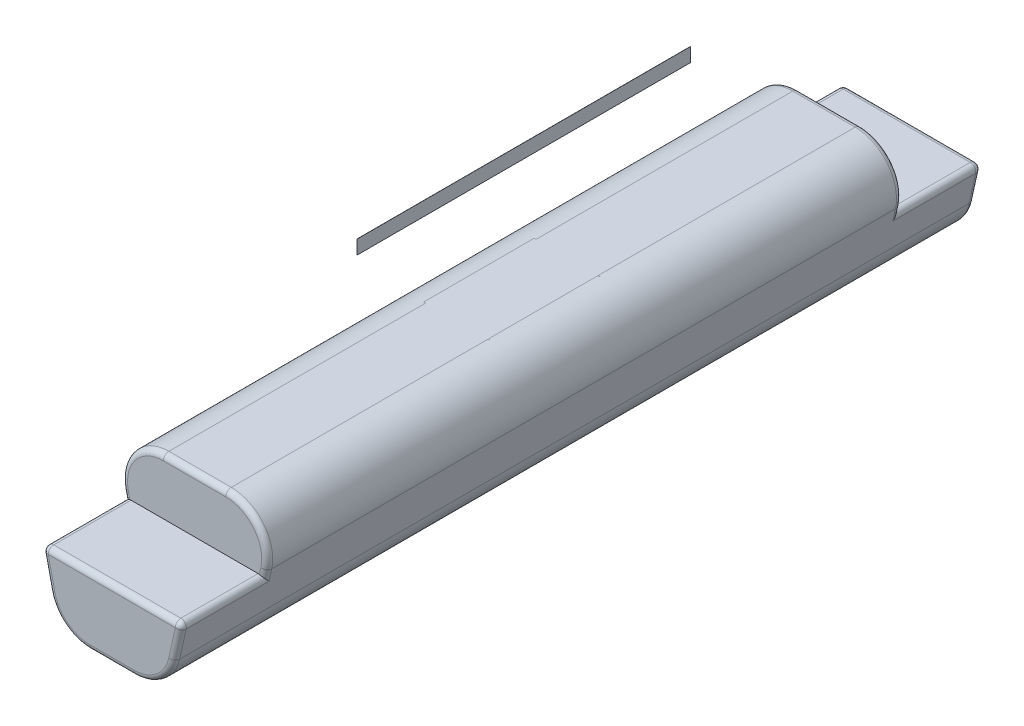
ISO-10303-21;
HEADER;
FILE_DESCRIPTION(('STEP AP214'),'2;1');
FILE_NAME('part.step','',(''),(''),'','','');
FILE_SCHEMA(('AUTOMOTIVE_DESIGN { 1 0 10303 214 1 1 1 1 }'));
ENDSEC;
DATA;
#1=APPLICATION_CONTEXT('core data for automotive mechanical design processes');
#2=APPLICATION_PROTOCOL_DEFINITION('international standard','automotive_design',2000,#1);
#3=PRODUCT_CONTEXT('',#1,'mechanical');
#4=PRODUCT('Part','Part','',(#3));
#5=PRODUCT_RELATED_PRODUCT_CATEGORY('part','',(#4));
#6=PRODUCT_DEFINITION_FORMATION('','',#4);
#7=PRODUCT_DEFINITION_CONTEXT('part definition',#1,'design');
#8=PRODUCT_DEFINITION('design','',#6,#7);
#9=PRODUCT_DEFINITION_SHAPE('','',#8);
#10=(LENGTH_UNIT() NAMED_UNIT(*) SI_UNIT(.MILLI.,.METRE.));
#11=(NAMED_UNIT(*) PLANE_ANGLE_UNIT() SI_UNIT($,.RADIAN.));
#12=(NAMED_UNIT(*) SI_UNIT($,.STERADIAN.) SOLID_ANGLE_UNIT());
#13=UNCERTAINTY_MEASURE_WITH_UNIT(LENGTH_MEASURE(1.E-05),#10,'distance_accuracy_value','');
#14=(GEOMETRIC_REPRESENTATION_CONTEXT(3) GLOBAL_UNCERTAINTY_ASSIGNED_CONTEXT((#13)) GLOBAL_UNIT_ASSIGNED_CONTEXT((#10,
#11,#12)) REPRESENTATION_CONTEXT('',''));
#15=CARTESIAN_POINT('',(0.,0.,0.));
#16=DIRECTION('',(0.,0.,1.));
#17=DIRECTION('',(1.,0.,0.));
#18=AXIS2_PLACEMENT_3D('',#15,#16,#17);
#19=CARTESIAN_POINT('',(-0.01,34.4220197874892,28.106052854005));
#20=DIRECTION('',(0.,0.,1.));
#21=DIRECTION('',(1.,0.,0.));
#22=AXIS2_PLACEMENT_3D('',#19,#20,#21);
#23=PLANE('',#22);
#24=DIRECTION('',(1.,0.,0.));
#25=VECTOR('',#24,1.);
#26=CARTESIAN_POINT('',(-0.01,31.8956330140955,28.106052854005));
#27=LINE('',#26,#25);
#28=CARTESIAN_POINT('',(-0.01,31.8956330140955,28.106052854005));
#29=VERTEX_POINT('',#28);
#30=CARTESIAN_POINT('',(0.01,31.8956330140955,28.106052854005));
#31=VERTEX_POINT('',#30);
#32=EDGE_CURVE('E250',#29,#31,#27,.T.);
#33=ORIENTED_EDGE('',*,*,#32,.T.);
#34=DIRECTION('',(0.,-1.,0.));
#35=VECTOR('',#34,1.);
#36=CARTESIAN_POINT('',(0.01,34.4220197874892,28.106052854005));
#37=LINE('',#36,#35);
#38=CARTESIAN_POINT('',(0.01,34.4220197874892,28.106052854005));
#39=VERTEX_POINT('',#38);
#40=EDGE_CURVE('E287',#39,#31,#37,.T.);
#41=ORIENTED_EDGE('',*,*,#40,.F.);
#42=DIRECTION('',(1.,0.,0.));
#43=VECTOR('',#42,1.);
#44=CARTESIAN_POINT('',(-0.01,34.4220197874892,28.106052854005));
#45=LINE('',#44,#43);
#46=CARTESIAN_POINT('',(-0.01,34.4220197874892,28.106052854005));
#47=VERTEX_POINT('',#46);
#48=EDGE_CURVE('E13',#47,#39,#45,.T.);
#49=ORIENTED_EDGE('',*,*,#48,.F.);
#50=DIRECTION('',(0.,-1.,0.));
#51=VECTOR('',#50,1.);
#52=CARTESIAN_POINT('',(-0.01,34.4220197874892,28.106052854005));
#53=LINE('',#52,#51);
#54=EDGE_CURVE('E288',#47,#29,#53,.T.);
#55=ORIENTED_EDGE('',*,*,#54,.T.);
#56=EDGE_LOOP('',(#33,#41,#49,#55));
#57=FACE_BOUND('',#56,.T.);
#58=ADVANCED_FACE('F247',(#57),#23,.T.);
#59=CARTESIAN_POINT('',(-0.01,34.4220197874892,28.106052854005));
#60=DIRECTION('',(0.,1.,0.));
#61=DIRECTION('',(0.,0.,1.));
#62=AXIS2_PLACEMENT_3D('',#59,#60,#61);
#63=PLANE('',#62);
#64=ORIENTED_EDGE('',*,*,#48,.T.);
#65=DIRECTION('',(0.,0.,1.));
#66=VECTOR('',#65,1.);
#67=CARTESIAN_POINT('',(0.01,34.4220197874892,28.106052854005));
#68=LINE('',#67,#66);
#69=CARTESIAN_POINT('',(0.01,34.4220197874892,-32.3166974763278));
#70=VERTEX_POINT('',#69);
#71=EDGE_CURVE('E304',#70,#39,#68,.T.);
#72=ORIENTED_EDGE('',*,*,#71,.F.);
#73=DIRECTION('',(1.,0.,0.));
#74=VECTOR('',#73,1.);
#75=CARTESIAN_POINT('',(-0.01,34.4220197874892,-32.3166974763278));
#76=LINE('',#75,#74);
#77=CARTESIAN_POINT('',(-0.01,34.4220197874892,-32.3166974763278));
#78=VERTEX_POINT('',#77);
#79=EDGE_CURVE('E255',#78,#70,#76,.T.);
#80=ORIENTED_EDGE('',*,*,#79,.F.);
#81=DIRECTION('',(0.,0.,1.));
#82=VECTOR('',#81,1.);
#83=CARTESIAN_POINT('',(-0.01,34.4220197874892,28.106052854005));
#84=LINE('',#83,#82);
#85=EDGE_CURVE('E293',#78,#47,#84,.T.);
#86=ORIENTED_EDGE('',*,*,#85,.T.);
#87=EDGE_LOOP('',(#64,#72,#80,#86));
#88=FACE_BOUND('',#87,.T.);
#89=ADVANCED_FACE('F319',(#88),#63,.T.);
#90=CARTESIAN_POINT('',(-0.01,34.4220197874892,-32.3166974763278));
#91=DIRECTION('',(0.,0.,-1.));
#92=DIRECTION('',(-1.,0.,0.));
#93=AXIS2_PLACEMENT_3D('',#90,#91,#92);
#94=PLANE('',#93);
#95=ORIENTED_EDGE('',*,*,#79,.T.);
#96=DIRECTION('',(0.,1.,0.));
#97=VECTOR('',#96,1.);
#98=CARTESIAN_POINT('',(0.01,34.4220197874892,-32.3166974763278));
#99=LINE('',#98,#97);
#100=CARTESIAN_POINT('',(0.01,31.8956330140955,-32.3166974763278));
#101=VERTEX_POINT('',#100);
#102=EDGE_CURVE('E300',#101,#70,#99,.T.);
#103=ORIENTED_EDGE('',*,*,#102,.F.);
#104=DIRECTION('',(1.,0.,0.));
#105=VECTOR('',#104,1.);
#106=CARTESIAN_POINT('',(-0.01,31.8956330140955,-32.3166974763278));
#107=LINE('',#106,#105);
#108=CARTESIAN_POINT('',(-0.01,31.8956330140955,-32.3166974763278));
#109=VERTEX_POINT('',#108);
#110=EDGE_CURVE('E292',#109,#101,#107,.T.);
#111=ORIENTED_EDGE('',*,*,#110,.F.);
#112=DIRECTION('',(0.,1.,0.));
#113=VECTOR('',#112,1.);
#114=CARTESIAN_POINT('',(-0.01,34.4220197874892,-32.3166974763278));
#115=LINE('',#114,#113);
#116=EDGE_CURVE('E312',#109,#78,#115,.T.);
#117=ORIENTED_EDGE('',*,*,#116,.T.);
#118=EDGE_LOOP('',(#95,#103,#111,#117));
#119=FACE_BOUND('',#118,.T.);
#120=ADVANCED_FACE('F316',(#119),#94,.T.);
#121=CARTESIAN_POINT('',(-0.01,31.8956330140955,28.106052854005));
#122=DIRECTION('',(0.,-1.,0.));
#123=DIRECTION('',(0.,0.,-1.));
#124=AXIS2_PLACEMENT_3D('',#121,#122,#123);
#125=PLANE('',#124);
#126=ORIENTED_EDGE('',*,*,#110,.T.);
#127=DIRECTION('',(0.,0.,-1.));
#128=VECTOR('',#127,1.);
#129=CARTESIAN_POINT('',(0.01,31.8956330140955,28.106052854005));
#130=LINE('',#129,#128);
#131=EDGE_CURVE('E295',#31,#101,#130,.T.);
#132=ORIENTED_EDGE('',*,*,#131,.F.);
#133=ORIENTED_EDGE('',*,*,#32,.F.);
#134=DIRECTION('',(0.,0.,-1.));
#135=VECTOR('',#134,1.);
#136=CARTESIAN_POINT('',(-0.01,31.8956330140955,28.106052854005));
#137=LINE('',#136,#135);
#138=EDGE_CURVE('E310',#29,#109,#137,.T.);
#139=ORIENTED_EDGE('',*,*,#138,.T.);
#140=EDGE_LOOP('',(#126,#132,#133,#139));
#141=FACE_BOUND('',#140,.T.);
#142=ADVANCED_FACE('F296',(#141),#125,.T.);
#143=CARTESIAN_POINT('',(-0.01,0.,0.));
#144=DIRECTION('',(1.,0.,0.));
#145=DIRECTION('',(0.,0.,-1.));
#146=AXIS2_PLACEMENT_3D('',#143,#144,#145);
#147=PLANE('',#146);
#148=ORIENTED_EDGE('',*,*,#54,.F.);
#149=ORIENTED_EDGE('',*,*,#85,.F.);
#150=ORIENTED_EDGE('',*,*,#116,.F.);
#151=ORIENTED_EDGE('',*,*,#138,.F.);
#152=EDGE_LOOP('',(#148,#149,#150,#151));
#153=FACE_BOUND('',#152,.T.);
#154=ADVANCED_FACE('F321',(#153),#147,.F.);
#155=CARTESIAN_POINT('',(0.01,0.,0.));
#156=DIRECTION('',(1.,0.,0.));
#157=DIRECTION('',(0.,0.,-1.));
#158=AXIS2_PLACEMENT_3D('',#155,#156,#157);
#159=PLANE('',#158);
#160=ORIENTED_EDGE('',*,*,#40,.T.);
#161=ORIENTED_EDGE('',*,*,#131,.T.);
#162=ORIENTED_EDGE('',*,*,#102,.T.);
#163=ORIENTED_EDGE('',*,*,#71,.T.);
#164=EDGE_LOOP('',(#160,#161,#162,#163));
#165=FACE_BOUND('',#164,.T.);
#166=ADVANCED_FACE('F303',(#165),#159,.T.);
#167=CLOSED_SHELL('',(#58,#89,#120,#142,#154,#166));
#168=MANIFOLD_SOLID_BREP('B2_NOT_SHOWN',#167);
#169=CARTESIAN_POINT('',(0.,0.,10.));
#170=DIRECTION('',(0.,0.,1.));
#171=DIRECTION('',(1.,0.,0.));
#172=AXIS2_PLACEMENT_3D('',#169,#170,#171);
#173=PLANE('',#172);
#174=CARTESIAN_POINT('',(5.65037961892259,5.,10.));
#175=DIRECTION('',(0.,0.,1.));
#176=DIRECTION('',(1.,0.,0.));
#177=AXIS2_PLACEMENT_3D('',#174,#175,#176);
#178=CIRCLE('',#177,7.5);
#179=CARTESIAN_POINT('',(5.97999285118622,12.4927535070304,10.));
#180=VERTEX_POINT('',#179);
#181=CARTESIAN_POINT('',(5.65037961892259,12.5,10.));
#182=VERTEX_POINT('',#181);
#183=EDGE_CURVE('E730',#180,#182,#178,.T.);
#184=ORIENTED_EDGE('',*,*,#183,.F.);
#185=CARTESIAN_POINT('',(11.9346584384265,12.5,7.5));
#186=CARTESIAN_POINT('',(11.1538820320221,12.5,7.5));
#187=CARTESIAN_POINT('',(10.9645159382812,11.7425356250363,7.5));
#188=CARTESIAN_POINT('',(11.9346584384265,12.5,7.34725693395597));
#189=CARTESIAN_POINT('',(11.1538820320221,12.5,7.38237981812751));
#190=CARTESIAN_POINT('',(10.9645159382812,11.7425356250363,7.39089780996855));
#191=CARTESIAN_POINT('',(11.9243334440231,12.5,7.19451386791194));
#192=CARTESIAN_POINT('',(11.145342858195,12.5,7.26469393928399));
#193=CARTESIAN_POINT('',(10.956967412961,11.7418415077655,7.2817956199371));
#194=CARTESIAN_POINT('',(11.8832327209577,12.5,6.89164312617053));
#195=CARTESIAN_POINT('',(11.1114250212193,12.5,7.03181820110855));
#196=CARTESIAN_POINT('',(10.9269189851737,11.739078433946,7.0654593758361));
#197=CARTESIAN_POINT('',(11.8524354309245,12.5,6.74151837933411));
#198=CARTESIAN_POINT('',(11.0859909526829,12.5,6.91650463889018));
#199=CARTESIAN_POINT('',(10.9044033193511,11.7370080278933,6.95822741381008));
#200=CARTESIAN_POINT('',(11.7709387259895,12.5,6.44644873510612));
#201=CARTESIAN_POINT('',(11.0188798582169,12.5,6.69066972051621));
#202=CARTESIAN_POINT('',(10.8448216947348,11.7315292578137,6.74746338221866));
#203=CARTESIAN_POINT('',(11.7201989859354,12.5,6.30151498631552));
#204=CARTESIAN_POINT('',(10.9770972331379,12.5,6.58004682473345));
#205=CARTESIAN_POINT('',(10.8077262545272,11.7281181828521,6.64393927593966));
#206=CARTESIAN_POINT('',(11.599703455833,12.5,6.0192977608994));
#207=CARTESIAN_POINT('',(10.8782267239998,12.5,6.36577056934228));
#208=CARTESIAN_POINT('',(10.71963288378,11.7200176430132,6.44235554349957));
#209=CARTESIAN_POINT('',(11.5298936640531,12.5,5.88203736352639));
#210=CARTESIAN_POINT('',(10.8209927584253,12.5,6.26204973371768));
#211=CARTESIAN_POINT('',(10.6685954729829,11.7153245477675,6.34431240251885));
#212=CARTESIAN_POINT('',(11.372464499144,12.5,5.61750265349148));
#213=CARTESIAN_POINT('',(10.6924753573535,12.5,6.06358880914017));
#214=CARTESIAN_POINT('',(10.5535002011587,11.7047410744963,6.1553590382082));
#215=CARTESIAN_POINT('',(11.2847839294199,12.5,5.49026479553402));
#216=CARTESIAN_POINT('',(10.621018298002,12.5,5.96882340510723));
#217=CARTESIAN_POINT('',(10.4893975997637,11.698846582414,6.06447485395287));
#218=CARTESIAN_POINT('',(11.0931184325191,12.5,5.24793866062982));
#219=CARTESIAN_POINT('',(10.4655994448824,12.5,5.79007464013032));
#220=CARTESIAN_POINT('',(10.3492724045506,11.6859615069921,5.89138475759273));
#221=CARTESIAN_POINT('',(10.9890719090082,12.5,5.13289914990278));
#222=CARTESIAN_POINT('',(10.3814510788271,12.5,5.70611178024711));
#223=CARTESIAN_POINT('',(10.2732047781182,11.6789667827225,5.80921367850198));
#224=CARTESIAN_POINT('',(10.7664527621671,12.5,4.91692625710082));
#225=CARTESIAN_POINT('',(10.2024483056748,12.5,5.55051944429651));
#226=CARTESIAN_POINT('',(10.1104496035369,11.6640007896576,5.65494732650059));
#227=CARTESIAN_POINT('',(10.6478242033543,12.5,4.81605058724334));
#228=CARTESIAN_POINT('',(10.1074090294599,12.5,5.47895547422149));
#229=CARTESIAN_POINT('',(10.0237211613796,11.6560257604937,5.58289327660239));
#230=CARTESIAN_POINT('',(10.398062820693,12.5,4.63012359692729));
#231=CARTESIAN_POINT('',(9.9086362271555,12.5,5.34942645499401));
#232=CARTESIAN_POINT('',(9.84112250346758,11.6392350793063,5.4500882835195));
#233=CARTESIAN_POINT('',(10.2668842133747,12.5,4.54513383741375));
#234=CARTESIAN_POINT('',(9.80473286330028,12.5,5.29156713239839));
#235=CARTESIAN_POINT('',(9.7452188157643,11.6304163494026,5.38938131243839));
#236=CARTESIAN_POINT('',(9.99425521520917,12.5,4.39243066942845));
#237=CARTESIAN_POINT('',(9.59040987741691,12.5,5.1903962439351));
#238=CARTESIAN_POINT('',(9.54590181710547,11.6120883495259,5.28030762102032));
#239=CARTESIAN_POINT('',(9.85277160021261,12.5,4.32477663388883));
#240=CARTESIAN_POINT('',(9.47984643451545,12.5,5.14722270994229));
#241=CARTESIAN_POINT('',(9.44246421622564,11.6025768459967,5.2319833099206));
#242=CARTESIAN_POINT('',(9.56193955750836,12.5,4.20790660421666));
#243=CARTESIAN_POINT('',(9.25449441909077,12.5,5.0760307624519));
#244=CARTESIAN_POINT('',(9.22983910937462,11.5830251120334,5.14850471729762));
#245=CARTESIAN_POINT('',(9.41257062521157,12.5,4.15874168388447));
#246=CARTESIAN_POINT('',(9.1395960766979,12.5,5.04817264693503));
#247=CARTESIAN_POINT('',(9.12063661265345,11.5729835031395,5.11338691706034));
#248=CARTESIAN_POINT('',(9.10851032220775,12.5,4.07970135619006));
#249=CARTESIAN_POINT('',(8.90791941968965,12.5,5.00786042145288));
#250=CARTESIAN_POINT('',(8.89834042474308,11.5525424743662,5.05692954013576));
#251=CARTESIAN_POINT('',(8.95380923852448,12.5,4.0498633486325));
#252=CARTESIAN_POINT('',(8.79107023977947,12.5,4.99557772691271));
#253=CARTESIAN_POINT('',(8.78523963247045,11.5421424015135,5.03561667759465));
#254=CARTESIAN_POINT('',(8.64172078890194,12.5,4.01000279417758));
#255=CARTESIAN_POINT('',(8.55782655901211,12.5,4.98629957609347));
#256=CARTESIAN_POINT('',(8.55707412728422,11.5211616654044,5.00714485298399));
#257=CARTESIAN_POINT('',(8.48433090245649,12.5,4.));
#258=CARTESIAN_POINT('',(8.44140184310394,12.5,4.98947530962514));
#259=CARTESIAN_POINT('',(8.44200757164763,11.5105808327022,5.));
#260=CARTESIAN_POINT('',(8.16955112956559,12.5,4.));
#261=CARTESIAN_POINT('',(8.21126265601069,12.5,5.01063664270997));
#262=CARTESIAN_POINT('',(8.21187446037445,11.4894191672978,5.));
#263=CARTESIAN_POINT('',(8.01216124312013,12.5,4.01000279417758));
#264=CARTESIAN_POINT('',(8.0975575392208,12.5,5.02878243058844));
#265=CARTESIAN_POINT('',(8.09680790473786,11.4788383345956,5.00714485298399));
#266=CARTESIAN_POINT('',(7.70007279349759,12.5,4.04986334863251));
#267=CARTESIAN_POINT('',(7.8749638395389,12.5,5.07906563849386));
#268=CARTESIAN_POINT('',(7.86864239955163,11.4578575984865,5.03561667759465));
#269=CARTESIAN_POINT('',(7.54537170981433,12.5,4.07970135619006));
#270=CARTESIAN_POINT('',(7.7661206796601,12.5,5.11134263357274));
#271=CARTESIAN_POINT('',(7.75554160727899,11.4474575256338,5.05692954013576));
#272=CARTESIAN_POINT('',(7.2413114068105,12.5,4.15874168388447));
#273=CARTESIAN_POINT('',(7.55513984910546,12.5,5.18876575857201));
#274=CARTESIAN_POINT('',(7.53324541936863,11.4270164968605,5.11338691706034));
#275=CARTESIAN_POINT('',(7.09194247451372,12.5,4.20790660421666));
#276=CARTESIAN_POINT('',(7.45307821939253,12.5,5.23402284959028));
#277=CARTESIAN_POINT('',(7.42404292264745,11.4169748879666,5.14850471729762));
#278=CARTESIAN_POINT('',(6.80111043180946,12.5,4.32477663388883));
#279=CARTESIAN_POINT('',(7.25727134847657,12.5,5.33603408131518));
#280=CARTESIAN_POINT('',(7.21141781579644,11.3974231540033,5.2319833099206));
#281=CARTESIAN_POINT('',(6.6596268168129,12.5,4.39243066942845));
#282=CARTESIAN_POINT('',(7.16362586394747,12.5,5.39286450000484));
#283=CARTESIAN_POINT('',(7.1079802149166,11.3879116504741,5.28030762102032));
#284=CARTESIAN_POINT('',(6.38699781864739,12.5,4.54513383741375));
#285=CARTESIAN_POINT('',(6.98593727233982,12.5,5.51647291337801));
#286=CARTESIAN_POINT('',(6.90866321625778,11.3695836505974,5.38938131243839));
#287=CARTESIAN_POINT('',(6.2558192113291,12.5,4.63012359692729));
#288=CARTESIAN_POINT('',(6.90200979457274,12.5,5.58328857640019));
#289=CARTESIAN_POINT('',(6.81275952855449,11.3607649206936,5.4500882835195));
#290=CARTESIAN_POINT('',(6.00605782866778,12.5,4.81605058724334));
#291=CARTESIAN_POINT('',(6.74469257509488,12.5,5.72522705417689));
#292=CARTESIAN_POINT('',(6.63016087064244,11.3439742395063,5.58289327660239));
#293=CARTESIAN_POINT('',(5.88742926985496,12.5,4.91692625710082));
#294=CARTESIAN_POINT('',(6.67142606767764,12.5,5.80034724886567));
#295=CARTESIAN_POINT('',(6.54343242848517,11.3359992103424,5.65494732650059));
#296=CARTESIAN_POINT('',(5.66481012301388,12.5,5.13289914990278));
#297=CARTESIAN_POINT('',(6.53601769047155,12.5,5.95725727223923));
#298=CARTESIAN_POINT('',(6.38067725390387,11.3210332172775,5.80921367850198));
#299=CARTESIAN_POINT('',(5.56076359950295,12.5,5.24793866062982));
#300=CARTESIAN_POINT('',(6.47399847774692,12.5,6.0390047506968));
#301=CARTESIAN_POINT('',(6.30460962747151,11.3140384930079,5.89138475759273));
#302=CARTESIAN_POINT('',(5.36909810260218,12.5,5.49026479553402));
#303=CARTESIAN_POINT('',(6.36135754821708,12.5,6.20762544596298));
#304=CARTESIAN_POINT('',(6.16448443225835,11.301153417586,6.06447485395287));
#305=CARTESIAN_POINT('',(5.28141753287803,12.5,5.61750265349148));
#306=CARTESIAN_POINT('',(6.31085029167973,12.5,6.29441923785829));
#307=CARTESIAN_POINT('',(6.10038183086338,11.2952589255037,6.1553590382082));
#308=CARTESIAN_POINT('',(5.12398836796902,12.5,5.88203736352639));
#309=CARTESIAN_POINT('',(6.2212584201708,12.5,6.47175647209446));
#310=CARTESIAN_POINT('',(5.98528655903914,11.2846754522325,6.34431240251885));
#311=CARTESIAN_POINT('',(5.05417857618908,12.5,6.0192977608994));
#312=CARTESIAN_POINT('',(6.18227341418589,12.5,6.56218789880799));
#313=CARTESIAN_POINT('',(5.93424914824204,11.2799823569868,6.44235554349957));
#314=CARTESIAN_POINT('',(4.93368304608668,12.5,6.30151498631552));
#315=CARTESIAN_POINT('',(6.11559484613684,12.5,6.74563594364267));
#316=CARTESIAN_POINT('',(5.84615577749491,11.2718818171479,6.64393927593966));
#317=CARTESIAN_POINT('',(4.88294330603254,12.5,6.44644873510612));
#318=CARTESIAN_POINT('',(6.08798063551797,12.5,6.83851389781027));
#319=CARTESIAN_POINT('',(5.80906033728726,11.2684707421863,6.74746338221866));
#320=CARTESIAN_POINT('',(4.80144660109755,12.5,6.74151837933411));
#321=CARTESIAN_POINT('',(6.04385861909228,12.5,7.02590500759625));
#322=CARTESIAN_POINT('',(5.74947871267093,11.2629919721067,6.95822741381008));
#323=CARTESIAN_POINT('',(4.77064931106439,12.5,6.89164312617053));
#324=CARTESIAN_POINT('',(6.02740588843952,12.5,7.12025983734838));
#325=CARTESIAN_POINT('',(5.72696304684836,11.260921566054,7.06545937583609));
#326=CARTESIAN_POINT('',(4.72954858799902,12.5,7.19451386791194));
#327=CARTESIAN_POINT('',(6.00546248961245,12.5,7.30982761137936));
#328=CARTESIAN_POINT('',(5.69691461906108,11.2581584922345,7.2817956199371));
#329=CARTESIAN_POINT('',(4.71922359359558,12.5,7.34725693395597));
#330=CARTESIAN_POINT('',(6.,12.5,7.40487020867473));
#331=CARTESIAN_POINT('',(5.68936609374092,11.2574643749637,7.39089780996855));
#332=CARTESIAN_POINT('',(4.71922359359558,12.5,7.65274306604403));
#333=CARTESIAN_POINT('',(6.,12.5,7.59512979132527));
#334=CARTESIAN_POINT('',(5.68936609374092,11.2574643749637,7.60910219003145));
#335=CARTESIAN_POINT('',(4.72954858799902,12.5,7.80548613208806));
#336=CARTESIAN_POINT('',(6.00546248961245,12.5,7.69017238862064));
#337=CARTESIAN_POINT('',(5.69691461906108,11.2581584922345,7.7182043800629));
#338=CARTESIAN_POINT('',(4.77064931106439,12.5,8.10835687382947));
#339=CARTESIAN_POINT('',(6.02740588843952,12.5,7.87974016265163));
#340=CARTESIAN_POINT('',(5.72696304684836,11.260921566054,7.9345406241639));
#341=CARTESIAN_POINT('',(4.80144660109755,12.5,8.25848162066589));
#342=CARTESIAN_POINT('',(6.04385861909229,12.5,7.97409499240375));
#343=CARTESIAN_POINT('',(5.74947871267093,11.2629919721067,8.04177258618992));
#344=CARTESIAN_POINT('',(4.88294330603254,12.5,8.55355126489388));
#345=CARTESIAN_POINT('',(6.08798063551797,12.5,8.16148610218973));
#346=CARTESIAN_POINT('',(5.80906033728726,11.2684707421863,8.25253661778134));
#347=CARTESIAN_POINT('',(4.93368304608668,12.5,8.69848501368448));
#348=CARTESIAN_POINT('',(6.11559484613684,12.5,8.25436405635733));
#349=CARTESIAN_POINT('',(5.84615577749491,11.2718818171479,8.35606072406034));
#350=CARTESIAN_POINT('',(5.05417857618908,12.5,8.9807022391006));
#351=CARTESIAN_POINT('',(6.18227341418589,12.5,8.43781210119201));
#352=CARTESIAN_POINT('',(5.93424914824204,11.2799823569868,8.55764445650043));
#353=CARTESIAN_POINT('',(5.12398836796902,12.5,9.11796263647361));
#354=CARTESIAN_POINT('',(6.2212584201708,12.5,8.52824352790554));
#355=CARTESIAN_POINT('',(5.98528655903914,11.2846754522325,8.65568759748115));
#356=CARTESIAN_POINT('',(5.28141753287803,12.5,9.38249734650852));
#357=CARTESIAN_POINT('',(6.31085029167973,12.5,8.70558076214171));
#358=CARTESIAN_POINT('',(6.10038183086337,11.2952589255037,8.8446409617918));
#359=CARTESIAN_POINT('',(5.36909810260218,12.5,9.50973520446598));
#360=CARTESIAN_POINT('',(6.36135754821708,12.5,8.79237455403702));
#361=CARTESIAN_POINT('',(6.16448443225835,11.301153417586,8.93552514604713));
#362=CARTESIAN_POINT('',(5.56076359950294,12.5,9.75206133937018));
#363=CARTESIAN_POINT('',(6.47399847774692,12.5,8.9609952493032));
#364=CARTESIAN_POINT('',(6.30460962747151,11.3140384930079,9.10861524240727));
#365=CARTESIAN_POINT('',(5.66481012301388,12.5,9.86710085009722));
#366=CARTESIAN_POINT('',(6.53601769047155,12.5,9.04274272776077));
#367=CARTESIAN_POINT('',(6.38067725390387,11.3210332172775,9.19078632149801));
#368=CARTESIAN_POINT('',(5.88742926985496,12.5,10.0830737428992));
#369=CARTESIAN_POINT('',(6.67142606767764,12.5,9.19965275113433));
#370=CARTESIAN_POINT('',(6.54343242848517,11.3359992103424,9.34505267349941));
#371=CARTESIAN_POINT('',(6.00605782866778,12.5,10.1839494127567));
#372=CARTESIAN_POINT('',(6.74469257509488,12.5,9.27477294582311));
#373=CARTESIAN_POINT('',(6.63016087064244,11.3439742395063,9.41710672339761));
#374=CARTESIAN_POINT('',(6.25581921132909,12.5,10.3698764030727));
#375=CARTESIAN_POINT('',(6.90200979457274,12.5,9.41671142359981));
#376=CARTESIAN_POINT('',(6.81275952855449,11.3607649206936,9.5499117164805));
#377=CARTESIAN_POINT('',(6.38699781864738,12.5,10.4548661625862));
#378=CARTESIAN_POINT('',(6.98593727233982,12.5,9.48352708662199));
#379=CARTESIAN_POINT('',(6.90866321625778,11.3695836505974,9.6106186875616));
#380=CARTESIAN_POINT('',(6.6596268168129,12.5,10.6075693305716));
#381=CARTESIAN_POINT('',(7.16362586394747,12.5,9.60713549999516));
#382=CARTESIAN_POINT('',(7.1079802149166,11.3879116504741,9.71969237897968));
#383=CARTESIAN_POINT('',(6.80111043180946,12.5,10.6752233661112));
#384=CARTESIAN_POINT('',(7.25727134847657,12.5,9.66396591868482));
#385=CARTESIAN_POINT('',(7.21141781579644,11.3974231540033,9.7680166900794));
#386=CARTESIAN_POINT('',(7.09194247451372,12.5,10.7920933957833));
#387=CARTESIAN_POINT('',(7.45307821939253,12.5,9.76597715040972));
#388=CARTESIAN_POINT('',(7.42404292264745,11.4169748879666,9.85149528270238));
#389=CARTESIAN_POINT('',(7.2413114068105,12.5,10.8412583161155));
#390=CARTESIAN_POINT('',(7.55513984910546,12.5,9.81123424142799));
#391=CARTESIAN_POINT('',(7.53324541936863,11.4270164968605,9.88661308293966));
#392=CARTESIAN_POINT('',(7.54537170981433,12.5,10.9202986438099));
#393=CARTESIAN_POINT('',(7.7661206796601,12.5,9.88865736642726));
#394=CARTESIAN_POINT('',(7.75554160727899,11.4474575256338,9.94307045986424));
#395=CARTESIAN_POINT('',(7.70007279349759,12.5,10.9501366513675));
#396=CARTESIAN_POINT('',(7.8749638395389,12.5,9.92093436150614));
#397=CARTESIAN_POINT('',(7.86864239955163,11.4578575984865,9.96438332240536));
#398=CARTESIAN_POINT('',(8.01216124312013,12.5,10.9899972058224));
#399=CARTESIAN_POINT('',(8.0975575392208,12.5,9.97121756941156));
#400=CARTESIAN_POINT('',(8.09680790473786,11.4788383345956,9.99285514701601));
#401=CARTESIAN_POINT('',(8.16955112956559,12.5,11.));
#402=CARTESIAN_POINT('',(8.21126265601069,12.5,9.98936335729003));
#403=CARTESIAN_POINT('',(8.21187446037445,11.4894191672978,10.));
#404=CARTESIAN_POINT('',(8.48433090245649,12.5,11.));
#405=CARTESIAN_POINT('',(8.44140184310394,12.5,10.0105246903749));
#406=CARTESIAN_POINT('',(8.44200757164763,11.5105808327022,10.));
#407=CARTESIAN_POINT('',(8.64172078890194,12.5,10.9899972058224));
#408=CARTESIAN_POINT('',(8.55782655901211,12.5,10.0137004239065));
#409=CARTESIAN_POINT('',(8.55707412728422,11.5211616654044,9.99285514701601));
#410=CARTESIAN_POINT('',(8.95380923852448,12.5,10.9501366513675));
#411=CARTESIAN_POINT('',(8.79107023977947,12.5,10.0044222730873));
#412=CARTESIAN_POINT('',(8.78523963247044,11.5421424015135,9.96438332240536));
#413=CARTESIAN_POINT('',(9.10851032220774,12.5,10.9202986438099));
#414=CARTESIAN_POINT('',(8.90791941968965,12.5,9.99213957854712));
#415=CARTESIAN_POINT('',(8.89834042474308,11.5525424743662,9.94307045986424));
#416=CARTESIAN_POINT('',(9.41257062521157,12.5,10.8412583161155));
#417=CARTESIAN_POINT('',(9.1395960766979,12.5,9.95182735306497));
#418=CARTESIAN_POINT('',(9.12063661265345,11.5729835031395,9.88661308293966));
#419=CARTESIAN_POINT('',(9.56193955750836,12.5,10.7920933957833));
#420=CARTESIAN_POINT('',(9.25449441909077,12.5,9.9239692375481));
#421=CARTESIAN_POINT('',(9.22983910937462,11.5830251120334,9.85149528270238));
#422=CARTESIAN_POINT('',(9.85277160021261,12.5,10.6752233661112));
#423=CARTESIAN_POINT('',(9.47984643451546,12.5,9.85277729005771));
#424=CARTESIAN_POINT('',(9.44246421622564,11.6025768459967,9.7680166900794));
#425=CARTESIAN_POINT('',(9.99425521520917,12.5,10.6075693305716));
#426=CARTESIAN_POINT('',(9.59040987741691,12.5,9.8096037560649));
#427=CARTESIAN_POINT('',(9.54590181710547,11.6120883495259,9.71969237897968));
#428=CARTESIAN_POINT('',(10.2668842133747,12.5,10.4548661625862));
#429=CARTESIAN_POINT('',(9.80473286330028,12.5,9.70843286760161));
#430=CARTESIAN_POINT('',(9.74521881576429,11.6304163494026,9.6106186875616));
#431=CARTESIAN_POINT('',(10.398062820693,12.5,10.3698764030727));
#432=CARTESIAN_POINT('',(9.9086362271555,12.5,9.65057354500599));
#433=CARTESIAN_POINT('',(9.84112250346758,11.6392350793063,9.5499117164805));
#434=CARTESIAN_POINT('',(10.6478242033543,12.5,10.1839494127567));
#435=CARTESIAN_POINT('',(10.1074090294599,12.5,9.52104452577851));
#436=CARTESIAN_POINT('',(10.0237211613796,11.6560257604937,9.41710672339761));
#437=CARTESIAN_POINT('',(10.7664527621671,12.5,10.0830737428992));
#438=CARTESIAN_POINT('',(10.2024483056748,12.5,9.4494805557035));
#439=CARTESIAN_POINT('',(10.1104496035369,11.6640007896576,9.34505267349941));
#440=CARTESIAN_POINT('',(10.9890719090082,12.5,9.86710085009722));
#441=CARTESIAN_POINT('',(10.3814510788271,12.5,9.2938882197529));
#442=CARTESIAN_POINT('',(10.2732047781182,11.6789667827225,9.19078632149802));
#443=CARTESIAN_POINT('',(11.0931184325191,12.5,9.75206133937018));
#444=CARTESIAN_POINT('',(10.4655994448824,12.5,9.20992535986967));
#445=CARTESIAN_POINT('',(10.3492724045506,11.6859615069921,9.10861524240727));
#446=CARTESIAN_POINT('',(11.2847839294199,12.5,9.50973520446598));
#447=CARTESIAN_POINT('',(10.621018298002,12.5,9.03117659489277));
#448=CARTESIAN_POINT('',(10.4893975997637,11.698846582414,8.93552514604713));
#449=CARTESIAN_POINT('',(11.372464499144,12.5,9.38249734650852));
#450=CARTESIAN_POINT('',(10.6924753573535,12.5,8.93641119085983));
#451=CARTESIAN_POINT('',(10.5535002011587,11.7047410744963,8.8446409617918));
#452=CARTESIAN_POINT('',(11.5298936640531,12.5,9.11796263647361));
#453=CARTESIAN_POINT('',(10.8209927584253,12.5,8.73795026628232));
#454=CARTESIAN_POINT('',(10.6685954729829,11.7153245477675,8.65568759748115));
#455=CARTESIAN_POINT('',(11.599703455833,12.5,8.9807022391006));
#456=CARTESIAN_POINT('',(10.8782267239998,12.5,8.63422943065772));
#457=CARTESIAN_POINT('',(10.71963288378,11.7200176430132,8.55764445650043));
#458=CARTESIAN_POINT('',(11.7201989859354,12.5,8.69848501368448));
#459=CARTESIAN_POINT('',(10.9770972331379,12.5,8.41995317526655));
#460=CARTESIAN_POINT('',(10.8077262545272,11.7281181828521,8.35606072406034));
#461=CARTESIAN_POINT('',(11.7709387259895,12.5,8.55355126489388));
#462=CARTESIAN_POINT('',(11.0188798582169,12.5,8.30933027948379));
#463=CARTESIAN_POINT('',(10.8448216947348,11.7315292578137,8.25253661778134));
#464=CARTESIAN_POINT('',(11.8524354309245,12.5,8.25848162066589));
#465=CARTESIAN_POINT('',(11.0859909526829,12.5,8.08349536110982));
#466=CARTESIAN_POINT('',(10.9044033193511,11.7370080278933,8.04177258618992));
#467=CARTESIAN_POINT('',(11.8832327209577,12.5,8.10835687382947));
#468=CARTESIAN_POINT('',(11.1114250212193,12.5,7.96818179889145));
#469=CARTESIAN_POINT('',(10.9269189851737,11.739078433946,7.9345406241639));
#470=CARTESIAN_POINT('',(11.9243334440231,12.5,7.80548613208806));
#471=CARTESIAN_POINT('',(11.145342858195,12.5,7.73530606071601));
#472=CARTESIAN_POINT('',(10.956967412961,11.7418415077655,7.7182043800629));
#473=CARTESIAN_POINT('',(11.9346584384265,12.5,7.65274306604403));
#474=CARTESIAN_POINT('',(11.1538820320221,12.5,7.61762018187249));
#475=CARTESIAN_POINT('',(10.9645159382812,11.7425356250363,7.60910219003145));
#476=CARTESIAN_POINT('',(11.9346584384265,12.5,7.5));
#477=CARTESIAN_POINT('',(11.1538820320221,12.5,7.5));
#478=CARTESIAN_POINT('',(10.9645159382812,11.7425356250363,7.5));
#479=(BOUNDED_SURFACE() B_SPLINE_SURFACE(3,2,((#185,#186,#187),(#188,#189,#190),(#191,#192,
#193),(#194,#195,#196),(#197,#198,#199),(#200,#201,#202),(#203,#204,#205),(#206,#207,#208),
(#209,#210,#211),(#212,#213,#214),(#215,#216,#217),(#218,#219,#220),(#221,#222,#223),(#224,#225,
#226),(#227,#228,#229),(#230,#231,#232),(#233,#234,#235),(#236,#237,#238),(#239,#240,#241),
(#242,#243,#244),(#245,#246,#247),(#248,#249,#250),(#251,#252,#253),(#254,#255,#256),(#257,#258,
#259),(#260,#261,#262),(#263,#264,#265),(#266,#267,#268),(#269,#270,#271),(#272,#273,#274),
(#275,#276,#277),(#278,#279,#280),(#281,#282,#283),(#284,#285,#286),(#287,#288,#289),(#290,#291,
#292),(#293,#294,#295),(#296,#297,#298),(#299,#300,#301),(#302,#303,#304),(#305,#306,#307),
(#308,#309,#310),(#311,#312,#313),(#314,#315,#316),(#317,#318,#319),(#320,#321,#322),(#323,#324,
#325),(#326,#327,#328),(#329,#330,#331),(#332,#333,#334),(#335,#336,#337),(#338,#339,#340),
(#341,#342,#343),(#344,#345,#346),(#347,#348,#349),(#350,#351,#352),(#353,#354,#355),(#356,#357,
#358),(#359,#360,#361),(#362,#363,#364),(#365,#366,#367),(#368,#369,#370),(#371,#372,#373),
(#374,#375,#376),(#377,#378,#379),(#380,#381,#382),(#383,#384,#385),(#386,#387,#388),(#389,#390,
#391),(#392,#393,#394),(#395,#396,#397),(#398,#399,#400),(#401,#402,#403),(#404,#405,#406),
(#407,#408,#409),(#410,#411,#412),(#413,#414,#415),(#416,#417,#418),(#419,#420,#421),(#422,#423,
#424),(#425,#426,#427),(#428,#429,#430),(#431,#432,#433),(#434,#435,#436),(#437,#438,#439),
(#440,#441,#442),(#443,#444,#445),(#446,#447,#448),(#449,#450,#451),(#452,#453,#454),(#455,#456,
#457),(#458,#459,#460),(#461,#462,#463),(#464,#465,#466),(#467,#468,#469),(#470,#471,#472),
(#473,#474,#475),(#476,#477,#478)),.UNSPECIFIED.,.T.,.F.,.F.) B_SPLINE_SURFACE_WITH_KNOTS((4,2,
2,2,2,2,2,2,2,2,2,2,2,2,2,2,2,2,2,2,2,2,2,2,2,2,2,2,2,2,2,2,2,2,2,2,2,2,2,2,2,2,2,2,2,2,2,2,4),
(3,3),(0.,0.457883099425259,0.916249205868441,1.3755469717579,1.83615908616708,2.29837585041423,
2.76237582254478,3.22821471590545,3.6958230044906,4.16501201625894,4.63548774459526,
5.10687119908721,5.5787238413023,6.05057648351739,6.52195993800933,6.99243566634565,
7.46162467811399,7.92923296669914,8.39507186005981,8.85907183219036,9.32128859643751,
9.78190071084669,10.2411984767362,10.6995645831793,11.1574476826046,11.6153307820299,
12.073696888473,12.5329946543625,12.9936067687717,13.4558235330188,13.9198235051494,
14.38566239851,14.8532706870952,15.3224596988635,15.7929354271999,16.2643188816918,
16.7361715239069,17.208024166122,17.6794076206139,18.1498833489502,18.6190723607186,
19.0866806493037,19.5525195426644,20.0165195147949,20.4787362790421,20.9393483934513,
21.3986461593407,21.8570122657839,22.3148953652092),(0.,1.),
.UNSPECIFIED.) GEOMETRIC_REPRESENTATION_ITEM() RATIONAL_B_SPLINE_SURFACE(((1.,0.788205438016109,
1.),(1.,0.788205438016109,1.),(1.,0.787985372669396,1.),(1.,0.787108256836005,1.),(1.,
0.786450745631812,1.),(1.,0.784707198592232,1.),(1.,0.783620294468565,1.),(1.,0.781031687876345,
1.),(1.,0.779528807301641,1.),(1.,0.776127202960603,1.),(1.,0.774227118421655,1.),(1.,
0.770055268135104,1.),(1.,0.76778209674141,1.),(1.,0.762893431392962,1.),(1.,0.760276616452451,
1.),(1.,0.75473521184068,1.),(1.,0.751809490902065,1.),(1.,0.745689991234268,1.),(1.,
0.742495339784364,1.),(1.,0.735882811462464,1.),(1.,0.732464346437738,1.),(1.,0.725454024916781,
1.),(1.,0.721861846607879,1.),(1.,0.714558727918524,1.),(1.,0.710847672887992,1.),(1.,
0.703365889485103,1.),(1.,0.699595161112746,1.),(1.,0.692057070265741,1.),(1.,0.688289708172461,
1.),(1.,0.680824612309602,1.),(1.,0.677126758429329,1.),(1.,0.66986917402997,1.),(1.,
0.666309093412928,1.),(1.,0.659396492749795,1.),(1.,0.656043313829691,1.),(1.,0.649613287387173,
1.),(1.,0.646535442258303,1.),(1.,0.640722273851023,1.),(1.,0.637985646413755,1.),(1.,
0.632916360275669,1.),(1.,0.630582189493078,1.),(1.,0.626372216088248,1.),(1.,0.624494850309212,
1.),(1.,0.621243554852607,1.),(1.,0.61986820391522,1.),(1.,0.617654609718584,1.),(1.,
0.616815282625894,1.),(1.,0.61569437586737,1.),(1.,0.615412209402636,1.),(1.,0.615412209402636,
1.),(1.,0.61569437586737,1.),(1.,0.616815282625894,1.),(1.,0.617654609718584,1.),(1.,
0.619868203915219,1.),(1.,0.621243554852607,1.),(1.,0.624494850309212,1.),(1.,0.626372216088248,
1.),(1.,0.630582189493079,1.),(1.,0.63291636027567,1.),(1.,0.637985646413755,1.),(1.,
0.640722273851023,1.),(1.,0.646535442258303,1.),(1.,0.649613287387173,1.),(1.,0.656043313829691,
1.),(1.,0.659396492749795,1.),(1.,0.666309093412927,1.),(1.,0.66986917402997,1.),(1.,
0.677126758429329,1.),(1.,0.680824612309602,1.),(1.,0.688289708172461,1.),(1.,0.692057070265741,
1.),(1.,0.699595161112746,1.),(1.,0.703365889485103,1.),(1.,0.710847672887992,1.),(1.,
0.714558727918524,1.),(1.,0.721861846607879,1.),(1.,0.725454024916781,1.),(1.,0.732464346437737,
1.),(1.,0.735882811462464,1.),(1.,0.742495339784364,1.),(1.,0.745689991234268,1.),(1.,
0.751809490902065,1.),(1.,0.75473521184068,1.),(1.,0.760276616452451,1.),(1.,0.762893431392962,
1.),(1.,0.76778209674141,1.),(1.,0.770055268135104,1.),(1.,0.774227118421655,1.),(1.,
0.776127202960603,1.),(1.,0.779528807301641,1.),(1.,0.781031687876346,1.),(1.,0.783620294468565,
1.),(1.,0.784707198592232,1.),(1.,0.786450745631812,1.),(1.,0.787108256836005,1.),(1.,
0.787985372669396,1.),(1.,0.788205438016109,1.),(1.,0.788205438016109,1.))) REPRESENTATION_ITEM('') SURFACE());
#480=CARTESIAN_POINT('',(5.97999285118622,12.4927535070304,10.));
#481=CARTESIAN_POINT('',(5.95038665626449,12.4951455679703,10.));
#482=CARTESIAN_POINT('',(5.92075634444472,12.4969454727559,10.));
#483=CARTESIAN_POINT('',(5.86144698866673,12.499360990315,10.));
#484=CARTESIAN_POINT('',(5.83176794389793,12.4999765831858,10.));
#485=CARTESIAN_POINT('',(5.80206478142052,12.5,10.));
#486=B_SPLINE_CURVE_WITH_KNOTS('',3,(#480,#481,#482,#483,#484,#485),.UNSPECIFIED.,.F.,.F.,(4,2,
4),(0.,0.0890547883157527,0.178111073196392),.UNSPECIFIED.);
#487=CARTESIAN_POINT('',(5.80206478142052,12.5,10.));
#488=VERTEX_POINT('',#487);
#489=EDGE_CURVE('E613',#180,#488,#486,.T.);
#490=ORIENTED_EDGE('',*,*,#489,.T.);
#491=DIRECTION('',(-1.,0.,0.));
#492=VECTOR('',#491,1.);
#493=CARTESIAN_POINT('',(6.,12.5,10.));
#494=LINE('',#493,#492);
#495=EDGE_CURVE('E850',#488,#182,#494,.T.);
#496=ORIENTED_EDGE('',*,*,#495,.T.);
#497=EDGE_LOOP('',(#184,#490,#496));
#498=FACE_BOUND('',#497,.T.);
#499=ADVANCED_FACE('F371',(#498),#173,.T.);
#500=CARTESIAN_POINT('',(12.7548521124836,1.39683450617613,-71.5));
#501=DIRECTION('',(-1.,0.,0.));
#502=DIRECTION('',(0.,0.,1.));
#503=AXIS2_PLACEMENT_3D('',#500,#501,#502);
#504=CYLINDRICAL_SURFACE('',#503,1.);
#505=CARTESIAN_POINT('',(11.5082360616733,1.39683450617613,-71.5));
#506=DIRECTION('',(-1.,0.,0.));
#507=DIRECTION('',(0.,0.,1.));
#508=AXIS2_PLACEMENT_3D('',#505,#506,#507);
#509=CIRCLE('',#508,1.);
#510=CARTESIAN_POINT('',(11.5082360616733,2.39683450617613,-71.5));
#511=VERTEX_POINT('',#510);
#512=CARTESIAN_POINT('',(11.5082360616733,1.39683450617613,-72.5));
#513=VERTEX_POINT('',#512);
#514=EDGE_CURVE('E1315',#511,#513,#509,.T.);
#515=ORIENTED_EDGE('',*,*,#514,.T.);
#516=DIRECTION('',(-1.,0.,0.));
#517=VECTOR('',#516,1.);
#518=CARTESIAN_POINT('',(0.,1.39683450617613,-72.5));
#519=LINE('',#518,#517);
#520=CARTESIAN_POINT('',(-11.5082360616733,1.39683450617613,-72.5));
#521=VERTEX_POINT('',#520);
#522=EDGE_CURVE('E1299',#521,#513,#519,.F.);
#523=ORIENTED_EDGE('',*,*,#522,.F.);
#524=CARTESIAN_POINT('',(-11.5082360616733,1.39683450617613,-71.5));
#525=DIRECTION('',(-1.,0.,0.));
#526=DIRECTION('',(0.,0.,1.));
#527=AXIS2_PLACEMENT_3D('',#524,#525,#526);
#528=CIRCLE('',#527,1.);
#529=CARTESIAN_POINT('',(-11.5082360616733,2.39683450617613,-71.5));
#530=VERTEX_POINT('',#529);
#531=EDGE_CURVE('E1312',#530,#521,#528,.T.);
#532=ORIENTED_EDGE('',*,*,#531,.F.);
#533=DIRECTION('',(-1.,0.,0.));
#534=VECTOR('',#533,1.);
#535=CARTESIAN_POINT('',(12.7548521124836,2.39683450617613,-71.5));
#536=LINE('',#535,#534);
#537=EDGE_CURVE('E1468',#511,#530,#536,.T.);
#538=ORIENTED_EDGE('',*,*,#537,.F.);
#539=EDGE_LOOP('',(#515,#523,#532,#538));
#540=FACE_BOUND('',#539,.T.);
#541=ADVANCED_FACE('F826',(#540),#504,.T.);
#542=CARTESIAN_POINT('',(-11.5082360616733,1.39683450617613,-71.5));
#543=DIRECTION('',(0.,-1.,0.));
#544=DIRECTION('',(0.,0.,-1.));
#545=AXIS2_PLACEMENT_3D('',#542,#543,#544);
#546=SPHERICAL_SURFACE('',#545,1.);
#547=ORIENTED_EDGE('',*,*,#531,.T.);
#548=CARTESIAN_POINT('',(-11.5082360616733,1.39683450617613,-71.5));
#549=DIRECTION('',(-0.216930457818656,0.976187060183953,0.));
#550=DIRECTION('',(-0.976187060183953,-0.216930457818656,0.));
#551=AXIS2_PLACEMENT_3D('',#548,#549,#550);
#552=CIRCLE('',#551,1.);
#553=CARTESIAN_POINT('',(-12.4844231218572,1.17990404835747,-71.5));
#554=VERTEX_POINT('',#553);
#555=EDGE_CURVE('E1317',#554,#521,#552,.F.);
#556=ORIENTED_EDGE('',*,*,#555,.F.);
#557=CARTESIAN_POINT('',(-11.5082360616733,1.39683450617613,-71.5));
#558=DIRECTION('',(0.,0.,1.));
#559=DIRECTION('',(1.,0.,0.));
#560=AXIS2_PLACEMENT_3D('',#557,#558,#559);
#561=CIRCLE('',#560,1.);
#562=EDGE_CURVE('E1322',#530,#554,#561,.T.);
#563=ORIENTED_EDGE('',*,*,#562,.F.);
#564=EDGE_LOOP('',(#547,#556,#563));
#565=FACE_BOUND('',#564,.T.);
#566=ADVANCED_FACE('F822',(#565),#546,.T.);
#567=CARTESIAN_POINT('',(12.7548521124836,2.39683450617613,-57.5));
#568=DIRECTION('',(0.,-1.,0.));
#569=DIRECTION('',(0.,0.,-1.));
#570=AXIS2_PLACEMENT_3D('',#567,#568,#569);
#571=PLANE('',#570);
#572=DIRECTION('',(-1.,0.,0.));
#573=VECTOR('',#572,1.);
#574=CARTESIAN_POINT('',(12.7548521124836,2.39683450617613,-57.5));
#575=LINE('',#574,#573);
#576=CARTESIAN_POINT('',(11.5082360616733,2.39683450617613,-57.5));
#577=VERTEX_POINT('',#576);
#578=CARTESIAN_POINT('',(-11.5082360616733,2.39683450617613,-57.5));
#579=VERTEX_POINT('',#578);
#580=EDGE_CURVE('E1349',#577,#579,#575,.T.);
#581=ORIENTED_EDGE('',*,*,#580,.F.);
#582=DIRECTION('',(0.,0.,-1.));
#583=VECTOR('',#582,1.);
#584=CARTESIAN_POINT('',(11.5082360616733,2.39683450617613,-71.5));
#585=LINE('',#584,#583);
#586=EDGE_CURVE('E1471',#577,#511,#585,.T.);
#587=ORIENTED_EDGE('',*,*,#586,.T.);
#588=ORIENTED_EDGE('',*,*,#537,.T.);
#589=DIRECTION('',(0.,0.,-1.));
#590=VECTOR('',#589,1.);
#591=CARTESIAN_POINT('',(-11.5082360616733,2.39683450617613,-57.5));
#592=LINE('',#591,#590);
#593=EDGE_CURVE('E1465',#530,#579,#592,.F.);
#594=ORIENTED_EDGE('',*,*,#593,.T.);
#595=EDGE_LOOP('',(#581,#587,#588,#594));
#596=FACE_BOUND('',#595,.T.);
#597=ADVANCED_FACE('F825',(#596),#571,.F.);
#598=CARTESIAN_POINT('',(11.5082360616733,1.39683450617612,-71.5));
#599=DIRECTION('',(0.,-1.,0.));
#600=DIRECTION('',(0.,0.,-1.));
#601=AXIS2_PLACEMENT_3D('',#598,#599,#600);
#602=SPHERICAL_SURFACE('',#601,1.);
#603=CARTESIAN_POINT('',(11.5082360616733,1.39683450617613,-71.5));
#604=DIRECTION('',(0.,0.,-1.));
#605=DIRECTION('',(-1.,0.,0.));
#606=AXIS2_PLACEMENT_3D('',#603,#604,#605);
#607=CIRCLE('',#606,1.);
#608=CARTESIAN_POINT('',(12.4844231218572,1.17990404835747,-71.5));
#609=VERTEX_POINT('',#608);
#610=EDGE_CURVE('E731',#511,#609,#607,.T.);
#611=ORIENTED_EDGE('',*,*,#610,.T.);
#612=CARTESIAN_POINT('',(11.5082360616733,1.39683450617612,-71.5));
#613=DIRECTION('',(-0.216930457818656,-0.976187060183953,0.));
#614=DIRECTION('',(0.976187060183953,-0.216930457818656,0.));
#615=AXIS2_PLACEMENT_3D('',#612,#613,#614);
#616=CIRCLE('',#615,1.);
#617=EDGE_CURVE('E1318',#513,#609,#616,.T.);
#618=ORIENTED_EDGE('',*,*,#617,.F.);
#619=ORIENTED_EDGE('',*,*,#514,.F.);
#620=EDGE_LOOP('',(#611,#618,#619));
#621=FACE_BOUND('',#620,.T.);
#622=ADVANCED_FACE('F837',(#621),#602,.T.);
#623=CARTESIAN_POINT('',(-5.65037961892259,5.,-57.5));
#624=DIRECTION('',(0.,0.,-1.));
#625=DIRECTION('',(-1.,0.,0.));
#626=AXIS2_PLACEMENT_3D('',#623,#624,#625);
#627=PLANE('',#626);
#628=ORIENTED_EDGE('',*,*,#580,.T.);
#629=CARTESIAN_POINT('',(-11.5082360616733,1.39683450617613,-57.5));
#630=DIRECTION('',(0.,0.,-1.));
#631=DIRECTION('',(-1.,0.,0.));
#632=AXIS2_PLACEMENT_3D('',#629,#630,#631);
#633=CIRCLE('',#632,1.);
#634=CARTESIAN_POINT('',(-11.7251665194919,2.37302156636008,-57.5));
#635=VERTEX_POINT('',#634);
#636=EDGE_CURVE('E852',#579,#635,#633,.F.);
#637=ORIENTED_EDGE('',*,*,#636,.T.);
#638=DIRECTION('',(-0.216930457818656,0.976187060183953,0.));
#639=VECTOR('',#638,1.);
#640=CARTESIAN_POINT('',(-11.9955955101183,3.58995202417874,-57.5));
#641=LINE('',#640,#639);
#642=CARTESIAN_POINT('',(-11.9955955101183,3.58995202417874,-57.5));
#643=VERTEX_POINT('',#642);
#644=EDGE_CURVE('E1440',#635,#643,#641,.T.);
#645=ORIENTED_EDGE('',*,*,#644,.T.);
#646=CARTESIAN_POINT('',(-5.65037961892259,5.,-57.5));
#647=DIRECTION('',(0.,0.,-1.));
#648=DIRECTION('',(-1.,0.,0.));
#649=AXIS2_PLACEMENT_3D('',#646,#647,#648);
#650=CIRCLE('',#649,6.5);
#651=CARTESIAN_POINT('',(-5.65037961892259,11.5,-57.5));
#652=VERTEX_POINT('',#651);
#653=EDGE_CURVE('E1437',#643,#652,#650,.T.);
#654=ORIENTED_EDGE('',*,*,#653,.T.);
#655=DIRECTION('',(1.,0.,0.));
#656=VECTOR('',#655,1.);
#657=CARTESIAN_POINT('',(-5.65037961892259,11.5,-57.5));
#658=LINE('',#657,#656);
#659=CARTESIAN_POINT('',(5.65037961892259,11.5,-57.5));
#660=VERTEX_POINT('',#659);
#661=EDGE_CURVE('E1420',#652,#660,#658,.T.);
#662=ORIENTED_EDGE('',*,*,#661,.T.);
#663=CARTESIAN_POINT('',(5.65037961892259,5.,-57.5));
#664=DIRECTION('',(0.,0.,-1.));
#665=DIRECTION('',(-1.,0.,0.));
#666=AXIS2_PLACEMENT_3D('',#663,#664,#665);
#667=CIRCLE('',#666,6.5);
#668=CARTESIAN_POINT('',(11.9955955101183,3.58995202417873,-57.5));
#669=VERTEX_POINT('',#668);
#670=EDGE_CURVE('E1431',#660,#669,#667,.T.);
#671=ORIENTED_EDGE('',*,*,#670,.T.);
#672=DIRECTION('',(-0.216930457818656,-0.976187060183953,0.));
#673=VECTOR('',#672,1.);
#674=CARTESIAN_POINT('',(11.4637950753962,1.19685006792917,-57.5));
#675=LINE('',#674,#673);
#676=CARTESIAN_POINT('',(11.7251665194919,2.37302156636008,-57.5));
#677=VERTEX_POINT('',#676);
#678=EDGE_CURVE('E1434',#669,#677,#675,.T.);
#679=ORIENTED_EDGE('',*,*,#678,.T.);
#680=CARTESIAN_POINT('',(11.5082360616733,1.39683450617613,-57.5));
#681=DIRECTION('',(0.,0.,-1.));
#682=DIRECTION('',(-1.,0.,0.));
#683=AXIS2_PLACEMENT_3D('',#680,#681,#682);
#684=CIRCLE('',#683,1.);
#685=EDGE_CURVE('E1482',#677,#577,#684,.F.);
#686=ORIENTED_EDGE('',*,*,#685,.T.);
#687=EDGE_LOOP('',(#628,#637,#645,#654,#662,#671,#679,#686));
#688=FACE_BOUND('',#687,.T.);
#689=ADVANCED_FACE('F839',(#688),#627,.T.);
#690=CARTESIAN_POINT('',(0.,0.,-72.5));
#691=DIRECTION('',(0.,0.,1.));
#692=DIRECTION('',(1.,0.,0.));
#693=AXIS2_PLACEMENT_3D('',#690,#691,#692);
#694=PLANE('',#693);
#695=DIRECTION('',(0.216930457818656,-0.976187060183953,0.));
#696=VECTOR('',#695,1.);
#697=CARTESIAN_POINT('',(-11.9955955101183,3.58995202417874,-72.5));
#698=LINE('',#697,#696);
#699=CARTESIAN_POINT('',(-10.3289288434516,-3.91004797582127,-72.5));
#700=VERTEX_POINT('',#699);
#701=EDGE_CURVE('E1297',#700,#521,#698,.F.);
#702=ORIENTED_EDGE('',*,*,#701,.T.);
#703=ORIENTED_EDGE('',*,*,#522,.T.);
#704=DIRECTION('',(0.216930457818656,0.976187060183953,0.));
#705=VECTOR('',#704,1.);
#706=CARTESIAN_POINT('',(10.3289288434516,-3.91004797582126,-72.5));
#707=LINE('',#706,#705);
#708=CARTESIAN_POINT('',(10.3289288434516,-3.91004797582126,-72.5));
#709=VERTEX_POINT('',#708);
#710=EDGE_CURVE('E1401',#513,#709,#707,.F.);
#711=ORIENTED_EDGE('',*,*,#710,.T.);
#712=CARTESIAN_POINT('',(3.98371295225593,-2.5,-72.5));
#713=DIRECTION('',(0.,0.,1.));
#714=DIRECTION('',(1.,0.,0.));
#715=AXIS2_PLACEMENT_3D('',#712,#713,#714);
#716=CIRCLE('',#715,6.5);
#717=CARTESIAN_POINT('',(3.98371295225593,-9.,-72.5));
#718=VERTEX_POINT('',#717);
#719=EDGE_CURVE('E1398',#709,#718,#716,.F.);
#720=ORIENTED_EDGE('',*,*,#719,.T.);
#721=DIRECTION('',(1.,0.,0.));
#722=VECTOR('',#721,1.);
#723=CARTESIAN_POINT('',(-3.98371295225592,-9.,-72.5));
#724=LINE('',#723,#722);
#725=CARTESIAN_POINT('',(-3.98371295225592,-9.,-72.5));
#726=VERTEX_POINT('',#725);
#727=EDGE_CURVE('E1395',#718,#726,#724,.F.);
#728=ORIENTED_EDGE('',*,*,#727,.T.);
#729=CARTESIAN_POINT('',(-3.98371295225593,-2.5,-72.5));
#730=DIRECTION('',(0.,0.,1.));
#731=DIRECTION('',(1.,0.,0.));
#732=AXIS2_PLACEMENT_3D('',#729,#730,#731);
#733=CIRCLE('',#732,6.5);
#734=EDGE_CURVE('E1302',#726,#700,#733,.F.);
#735=ORIENTED_EDGE('',*,*,#734,.T.);
#736=EDGE_LOOP('',(#702,#703,#711,#720,#728,#735));
#737=FACE_BOUND('',#736,.T.);
#738=ADVANCED_FACE('F755',(#737),#694,.F.);
#739=CARTESIAN_POINT('',(-5.65037961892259,11.5,-56.5));
#740=DIRECTION('',(1.,0.,0.));
#741=DIRECTION('',(0.,0.,-1.));
#742=AXIS2_PLACEMENT_3D('',#739,#740,#741);
#743=CYLINDRICAL_SURFACE('',#742,1.);
#744=CARTESIAN_POINT('',(5.65037961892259,11.5,-56.5));
#745=DIRECTION('',(-1.,0.,0.));
#746=DIRECTION('',(0.,0.,1.));
#747=AXIS2_PLACEMENT_3D('',#744,#745,#746);
#748=CIRCLE('',#747,1.);
#749=CARTESIAN_POINT('',(5.65037961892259,12.5,-56.5));
#750=VERTEX_POINT('',#749);
#751=EDGE_CURVE('E1326',#750,#660,#748,.T.);
#752=ORIENTED_EDGE('',*,*,#751,.T.);
#753=ORIENTED_EDGE('',*,*,#661,.F.);
#754=CARTESIAN_POINT('',(-5.65037961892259,11.5,-56.5));
#755=DIRECTION('',(-1.,0.,0.));
#756=DIRECTION('',(0.,0.,1.));
#757=AXIS2_PLACEMENT_3D('',#754,#755,#756);
#758=CIRCLE('',#757,1.);
#759=CARTESIAN_POINT('',(-5.65037961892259,12.5,-56.5));
#760=VERTEX_POINT('',#759);
#761=EDGE_CURVE('E1493',#760,#652,#758,.T.);
#762=ORIENTED_EDGE('',*,*,#761,.F.);
#763=DIRECTION('',(1.,0.,0.));
#764=VECTOR('',#763,1.);
#765=CARTESIAN_POINT('',(-15.,12.5,-56.5));
#766=LINE('',#765,#764);
#767=EDGE_CURVE('E1478',#750,#760,#766,.F.);
#768=ORIENTED_EDGE('',*,*,#767,.F.);
#769=EDGE_LOOP('',(#752,#753,#762,#768));
#770=FACE_BOUND('',#769,.T.);
#771=ADVANCED_FACE('F803',(#770),#743,.T.);
#772=CARTESIAN_POINT('',(-14.023812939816,12.7169304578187,-71.5));
#773=DIRECTION('',(-0.216930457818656,0.976187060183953,0.));
#774=DIRECTION('',(-0.976187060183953,-0.216930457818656,0.));
#775=AXIS2_PLACEMENT_3D('',#772,#773,#774);
#776=CYLINDRICAL_SURFACE('',#775,1.);
#777=DIRECTION('',(0.216930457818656,-0.976187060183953,0.));
#778=VECTOR('',#777,1.);
#779=CARTESIAN_POINT('',(-11.3051159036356,-4.12697843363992,-71.5));
#780=LINE('',#779,#778);
#781=CARTESIAN_POINT('',(-11.3051159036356,-4.12697843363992,-71.5));
#782=VERTEX_POINT('',#781);
#783=EDGE_CURVE('E1418',#554,#782,#780,.T.);
#784=ORIENTED_EDGE('',*,*,#783,.F.);
#785=ORIENTED_EDGE('',*,*,#555,.T.);
#786=ORIENTED_EDGE('',*,*,#701,.F.);
#787=CARTESIAN_POINT('',(-10.3289288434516,-3.91004797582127,-71.5));
#788=DIRECTION('',(-0.216930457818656,0.976187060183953,0.));
#789=DIRECTION('',(-0.976187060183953,-0.216930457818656,0.));
#790=AXIS2_PLACEMENT_3D('',#787,#788,#789);
#791=CIRCLE('',#790,1.);
#792=EDGE_CURVE('E1376',#700,#782,#791,.T.);
#793=ORIENTED_EDGE('',*,*,#792,.T.);
#794=EDGE_LOOP('',(#784,#785,#786,#793));
#795=FACE_BOUND('',#794,.T.);
#796=ADVANCED_FACE('F799',(#795),#776,.T.);
#797=CARTESIAN_POINT('',(-11.5082360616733,1.39683450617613,-72.5));
#798=DIRECTION('',(0.,0.,1.));
#799=DIRECTION('',(1.,0.,0.));
#800=AXIS2_PLACEMENT_3D('',#797,#798,#799);
#801=CYLINDRICAL_SURFACE('',#800,1.);
#802=ORIENTED_EDGE('',*,*,#562,.T.);
#803=DIRECTION('',(0.,0.,-1.));
#804=VECTOR('',#803,1.);
#805=CARTESIAN_POINT('',(-12.4844231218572,1.17990404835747,-71.5));
#806=LINE('',#805,#804);
#807=CARTESIAN_POINT('',(-12.4844231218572,1.17990404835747,-56.5));
#808=VERTEX_POINT('',#807);
#809=EDGE_CURVE('E1444',#808,#554,#806,.T.);
#810=ORIENTED_EDGE('',*,*,#809,.F.);
#811=CARTESIAN_POINT('',(-11.5082360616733,1.39683450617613,-56.5));
#812=DIRECTION('',(-0.153392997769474,0.690268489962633,0.707106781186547));
#813=DIRECTION('',(-0.153392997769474,0.690268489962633,-0.707106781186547));
#814=AXIS2_PLACEMENT_3D('',#811,#812,#813);
#815=ELLIPSE('',#814,1.41421356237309,1.);
#816=EDGE_CURVE('E1490',#635,#808,#815,.T.);
#817=ORIENTED_EDGE('',*,*,#816,.F.);
#818=ORIENTED_EDGE('',*,*,#636,.F.);
#819=ORIENTED_EDGE('',*,*,#593,.F.);
#820=EDGE_LOOP('',(#802,#810,#817,#818,#819));
#821=FACE_BOUND('',#820,.T.);
#822=ADVANCED_FACE('F802',(#821),#801,.T.);
#823=CARTESIAN_POINT('',(-11.9955955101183,3.58995202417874,-56.5));
#824=DIRECTION('',(-0.216930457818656,0.976187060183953,0.));
#825=DIRECTION('',(-0.976187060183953,-0.216930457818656,0.));
#826=AXIS2_PLACEMENT_3D('',#823,#824,#825);
#827=CYLINDRICAL_SURFACE('',#826,1.);
#828=ORIENTED_EDGE('',*,*,#816,.T.);
#829=DIRECTION('',(-0.216930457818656,0.976187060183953,0.));
#830=VECTOR('',#829,1.);
#831=CARTESIAN_POINT('',(-15.,12.5,-56.5));
#832=LINE('',#831,#830);
#833=CARTESIAN_POINT('',(-12.9717825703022,3.37302156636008,-56.5));
#834=VERTEX_POINT('',#833);
#835=EDGE_CURVE('E1447',#834,#808,#832,.F.);
#836=ORIENTED_EDGE('',*,*,#835,.F.);
#837=CARTESIAN_POINT('',(-11.9955955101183,3.58995202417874,-56.5));
#838=DIRECTION('',(0.216930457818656,-0.976187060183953,0.));
#839=DIRECTION('',(0.976187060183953,0.216930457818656,0.));
#840=AXIS2_PLACEMENT_3D('',#837,#838,#839);
#841=CIRCLE('',#840,1.);
#842=EDGE_CURVE('E1487',#834,#643,#841,.T.);
#843=ORIENTED_EDGE('',*,*,#842,.T.);
#844=ORIENTED_EDGE('',*,*,#644,.F.);
#845=EDGE_LOOP('',(#828,#836,#843,#844));
#846=FACE_BOUND('',#845,.T.);
#847=ADVANCED_FACE('F808',(#846),#827,.T.);
#848=CARTESIAN_POINT('',(11.4637950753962,1.19685006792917,-56.5));
#849=DIRECTION('',(-0.216930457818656,-0.976187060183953,0.));
#850=DIRECTION('',(0.976187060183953,-0.216930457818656,0.));
#851=AXIS2_PLACEMENT_3D('',#848,#849,#850);
#852=CYLINDRICAL_SURFACE('',#851,1.);
#853=CARTESIAN_POINT('',(11.5082360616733,1.39683450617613,-56.5));
#854=DIRECTION('',(-0.153392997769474,-0.690268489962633,-0.707106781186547));
#855=DIRECTION('',(-0.153392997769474,-0.690268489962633,0.707106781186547));
#856=AXIS2_PLACEMENT_3D('',#853,#854,#855);
#857=ELLIPSE('',#856,1.41421356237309,1.);
#858=CARTESIAN_POINT('',(12.4844231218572,1.17990404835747,-56.5));
#859=VERTEX_POINT('',#858);
#860=EDGE_CURVE('E1340',#859,#677,#857,.F.);
#861=ORIENTED_EDGE('',*,*,#860,.T.);
#862=ORIENTED_EDGE('',*,*,#678,.F.);
#863=CARTESIAN_POINT('',(11.9955955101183,3.58995202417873,-56.5));
#864=DIRECTION('',(0.216930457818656,0.976187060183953,0.));
#865=DIRECTION('',(-0.976187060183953,0.216930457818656,0.));
#866=AXIS2_PLACEMENT_3D('',#863,#864,#865);
#867=CIRCLE('',#866,1.);
#868=CARTESIAN_POINT('',(12.9717825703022,3.37302156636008,-56.5));
#869=VERTEX_POINT('',#868);
#870=EDGE_CURVE('E1325',#869,#669,#867,.T.);
#871=ORIENTED_EDGE('',*,*,#870,.F.);
#872=DIRECTION('',(-0.216930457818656,-0.976187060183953,0.));
#873=VECTOR('',#872,1.);
#874=CARTESIAN_POINT('',(10.,-10.,-56.5));
#875=LINE('',#874,#873);
#876=EDGE_CURVE('E1457',#859,#869,#875,.F.);
#877=ORIENTED_EDGE('',*,*,#876,.F.);
#878=EDGE_LOOP('',(#861,#862,#871,#877));
#879=FACE_BOUND('',#878,.T.);
#880=ADVANCED_FACE('F811',(#879),#852,.T.);
#881=CARTESIAN_POINT('',(11.5082360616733,1.39683450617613,-57.5));
#882=DIRECTION('',(0.,0.,1.));
#883=DIRECTION('',(1.,0.,0.));
#884=AXIS2_PLACEMENT_3D('',#881,#882,#883);
#885=CYLINDRICAL_SURFACE('',#884,1.);
#886=ORIENTED_EDGE('',*,*,#860,.F.);
#887=DIRECTION('',(0.,0.,-1.));
#888=VECTOR('',#887,1.);
#889=CARTESIAN_POINT('',(12.4844231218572,1.17990404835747,-57.5));
#890=LINE('',#889,#888);
#891=EDGE_CURVE('E1454',#609,#859,#890,.F.);
#892=ORIENTED_EDGE('',*,*,#891,.F.);
#893=ORIENTED_EDGE('',*,*,#610,.F.);
#894=ORIENTED_EDGE('',*,*,#586,.F.);
#895=ORIENTED_EDGE('',*,*,#685,.F.);
#896=EDGE_LOOP('',(#886,#892,#893,#894,#895));
#897=FACE_BOUND('',#896,.T.);
#898=ADVANCED_FACE('F788',(#897),#885,.T.);
#899=CARTESIAN_POINT('',(9.02381293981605,-9.78306954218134,-71.5));
#900=DIRECTION('',(-0.216930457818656,-0.976187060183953,0.));
#901=DIRECTION('',(0.976187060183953,-0.216930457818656,0.));
#902=AXIS2_PLACEMENT_3D('',#899,#900,#901);
#903=CYLINDRICAL_SURFACE('',#902,1.);
#904=ORIENTED_EDGE('',*,*,#710,.F.);
#905=ORIENTED_EDGE('',*,*,#617,.T.);
#906=DIRECTION('',(0.216930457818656,0.976187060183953,0.));
#907=VECTOR('',#906,1.);
#908=CARTESIAN_POINT('',(12.9717825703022,3.37302156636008,-71.5));
#909=LINE('',#908,#907);
#910=CARTESIAN_POINT('',(11.3051159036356,-4.12697843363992,-71.5));
#911=VERTEX_POINT('',#910);
#912=EDGE_CURVE('E1404',#911,#609,#909,.T.);
#913=ORIENTED_EDGE('',*,*,#912,.F.);
#914=CARTESIAN_POINT('',(10.3289288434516,-3.91004797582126,-71.5));
#915=DIRECTION('',(0.216930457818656,0.976187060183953,0.));
#916=DIRECTION('',(-0.976187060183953,0.216930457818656,0.));
#917=AXIS2_PLACEMENT_3D('',#914,#915,#916);
#918=CIRCLE('',#917,1.);
#919=EDGE_CURVE('E1356',#911,#709,#918,.T.);
#920=ORIENTED_EDGE('',*,*,#919,.T.);
#921=EDGE_LOOP('',(#904,#905,#913,#920));
#922=FACE_BOUND('',#921,.T.);
#923=ADVANCED_FACE('F784',(#922),#903,.T.);
#924=CARTESIAN_POINT('',(5.65037961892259,5.,-56.5));
#925=DIRECTION('',(0.,0.,-1.));
#926=DIRECTION('',(-1.,0.,0.));
#927=AXIS2_PLACEMENT_3D('',#924,#925,#926);
#928=TOROIDAL_SURFACE('',#927,6.5,1.);
#929=ORIENTED_EDGE('',*,*,#870,.T.);
#930=ORIENTED_EDGE('',*,*,#670,.F.);
#931=ORIENTED_EDGE('',*,*,#751,.F.);
#932=CARTESIAN_POINT('',(5.65037961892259,5.,-56.5));
#933=DIRECTION('',(0.,0.,-1.));
#934=DIRECTION('',(-1.,0.,0.));
#935=AXIS2_PLACEMENT_3D('',#932,#933,#934);
#936=CIRCLE('',#935,7.5);
#937=EDGE_CURVE('E1461',#869,#750,#936,.F.);
#938=ORIENTED_EDGE('',*,*,#937,.F.);
#939=EDGE_LOOP('',(#929,#930,#931,#938));
#940=FACE_BOUND('',#939,.T.);
#941=ADVANCED_FACE('F787',(#940),#928,.T.);
#942=CARTESIAN_POINT('',(-5.65037961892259,5.,-56.5));
#943=DIRECTION('',(0.,0.,-1.));
#944=DIRECTION('',(-1.,0.,0.));
#945=AXIS2_PLACEMENT_3D('',#942,#943,#944);
#946=TOROIDAL_SURFACE('',#945,6.5,1.);
#947=ORIENTED_EDGE('',*,*,#761,.T.);
#948=ORIENTED_EDGE('',*,*,#653,.F.);
#949=ORIENTED_EDGE('',*,*,#842,.F.);
#950=CARTESIAN_POINT('',(-5.65037961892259,5.,-56.5));
#951=DIRECTION('',(0.,0.,-1.));
#952=DIRECTION('',(-1.,0.,0.));
#953=AXIS2_PLACEMENT_3D('',#950,#951,#952);
#954=CIRCLE('',#953,7.5);
#955=EDGE_CURVE('E1450',#760,#834,#954,.F.);
#956=ORIENTED_EDGE('',*,*,#955,.F.);
#957=EDGE_LOOP('',(#947,#948,#949,#956));
#958=FACE_BOUND('',#957,.T.);
#959=ADVANCED_FACE('F797',(#958),#946,.T.);
#960=CARTESIAN_POINT('',(-10.,-9.,-71.5));
#961=DIRECTION('',(-1.,0.,0.));
#962=DIRECTION('',(0.,-1.,0.));
#963=AXIS2_PLACEMENT_3D('',#960,#961,#962);
#964=CYLINDRICAL_SURFACE('',#963,1.);
#965=CARTESIAN_POINT('',(-3.98371295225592,-9.,-71.5));
#966=DIRECTION('',(1.,0.,0.));
#967=DIRECTION('',(0.,0.,-1.));
#968=AXIS2_PLACEMENT_3D('',#965,#966,#967);
#969=CIRCLE('',#968,1.);
#970=CARTESIAN_POINT('',(-3.98371295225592,-10.,-71.5));
#971=VERTEX_POINT('',#970);
#972=EDGE_CURVE('E1425',#971,#726,#969,.T.);
#973=ORIENTED_EDGE('',*,*,#972,.T.);
#974=ORIENTED_EDGE('',*,*,#727,.F.);
#975=CARTESIAN_POINT('',(3.98371295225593,-9.,-71.5));
#976=DIRECTION('',(1.,0.,0.));
#977=DIRECTION('',(0.,0.,-1.));
#978=AXIS2_PLACEMENT_3D('',#975,#976,#977);
#979=CIRCLE('',#978,1.);
#980=CARTESIAN_POINT('',(3.98371295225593,-10.,-71.5));
#981=VERTEX_POINT('',#980);
#982=EDGE_CURVE('E1366',#981,#718,#979,.T.);
#983=ORIENTED_EDGE('',*,*,#982,.F.);
#984=DIRECTION('',(1.,0.,0.));
#985=VECTOR('',#984,1.);
#986=CARTESIAN_POINT('',(3.98371295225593,-10.,-71.5));
#987=LINE('',#986,#985);
#988=EDGE_CURVE('E1412',#971,#981,#987,.T.);
#989=ORIENTED_EDGE('',*,*,#988,.F.);
#990=EDGE_LOOP('',(#973,#974,#983,#989));
#991=FACE_BOUND('',#990,.T.);
#992=ADVANCED_FACE('F793',(#991),#964,.T.);
#993=CARTESIAN_POINT('',(3.98371295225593,-2.5,-71.5));
#994=DIRECTION('',(0.,0.,1.));
#995=DIRECTION('',(1.,0.,0.));
#996=AXIS2_PLACEMENT_3D('',#993,#994,#995);
#997=TOROIDAL_SURFACE('',#996,6.5,1.);
#998=ORIENTED_EDGE('',*,*,#982,.T.);
#999=ORIENTED_EDGE('',*,*,#719,.F.);
#1000=ORIENTED_EDGE('',*,*,#919,.F.);
#1001=CARTESIAN_POINT('',(3.98371295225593,-2.5,-71.5));
#1002=DIRECTION('',(0.,0.,1.));
#1003=DIRECTION('',(1.,0.,0.));
#1004=AXIS2_PLACEMENT_3D('',#1001,#1002,#1003);
#1005=CIRCLE('',#1004,7.5);
#1006=EDGE_CURVE('E1408',#981,#911,#1005,.T.);
#1007=ORIENTED_EDGE('',*,*,#1006,.F.);
#1008=EDGE_LOOP('',(#998,#999,#1000,#1007));
#1009=FACE_BOUND('',#1008,.T.);
#1010=ADVANCED_FACE('F790',(#1009),#997,.T.);
#1011=CARTESIAN_POINT('',(-3.98371295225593,-2.5,-71.5));
#1012=DIRECTION('',(0.,0.,1.));
#1013=DIRECTION('',(1.,0.,0.));
#1014=AXIS2_PLACEMENT_3D('',#1011,#1012,#1013);
#1015=TOROIDAL_SURFACE('',#1014,6.5,1.);
#1016=ORIENTED_EDGE('',*,*,#972,.F.);
#1017=CARTESIAN_POINT('',(-3.98371295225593,-2.5,-71.5));
#1018=DIRECTION('',(0.,0.,1.));
#1019=DIRECTION('',(1.,0.,0.));
#1020=AXIS2_PLACEMENT_3D('',#1017,#1018,#1019);
#1021=CIRCLE('',#1020,7.5);
#1022=EDGE_CURVE('E1414',#782,#971,#1021,.T.);
#1023=ORIENTED_EDGE('',*,*,#1022,.F.);
#1024=ORIENTED_EDGE('',*,*,#792,.F.);
#1025=ORIENTED_EDGE('',*,*,#734,.F.);
#1026=EDGE_LOOP('',(#1016,#1023,#1024,#1025));
#1027=FACE_BOUND('',#1026,.T.);
#1028=ADVANCED_FACE('F776',(#1027),#1015,.T.);
#1029=CARTESIAN_POINT('',(-5.65037961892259,5.,-72.5));
#1030=DIRECTION('',(0.,0.,1.));
#1031=DIRECTION('',(1.,0.,0.));
#1032=AXIS2_PLACEMENT_3D('',#1029,#1030,#1031);
#1033=CYLINDRICAL_SURFACE('',#1032,7.5);
#1034=CARTESIAN_POINT('',(-5.65037961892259,5.,-10.));
#1035=DIRECTION('',(0.,0.,1.));
#1036=DIRECTION('',(1.,0.,0.));
#1037=AXIS2_PLACEMENT_3D('',#1034,#1035,#1036);
#1038=CIRCLE('',#1037,7.5);
#1039=CARTESIAN_POINT('',(-5.65037961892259,12.5,-10.));
#1040=VERTEX_POINT('',#1039);
#1041=CARTESIAN_POINT('',(-5.99798509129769,12.4919403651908,-10.));
#1042=VERTEX_POINT('',#1041);
#1043=EDGE_CURVE('E1370',#1040,#1042,#1038,.T.);
#1044=ORIENTED_EDGE('',*,*,#1043,.F.);
#1045=DIRECTION('',(0.,0.,1.));
#1046=VECTOR('',#1045,1.);
#1047=CARTESIAN_POINT('',(-5.65037961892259,12.5,-72.5));
#1048=LINE('',#1047,#1046);
#1049=EDGE_CURVE('E1375',#760,#1040,#1048,.T.);
#1050=ORIENTED_EDGE('',*,*,#1049,.F.);
#1051=ORIENTED_EDGE('',*,*,#955,.T.);
#1052=DIRECTION('',(0.,0.,1.));
#1053=VECTOR('',#1052,1.);
#1054=CARTESIAN_POINT('',(-12.9717825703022,3.37302156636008,-72.5));
#1055=LINE('',#1054,#1053);
#1056=CARTESIAN_POINT('',(-12.9717825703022,3.37302156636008,56.5));
#1057=VERTEX_POINT('',#1056);
#1058=EDGE_CURVE('E1579',#1057,#834,#1055,.F.);
#1059=ORIENTED_EDGE('',*,*,#1058,.F.);
#1060=CARTESIAN_POINT('',(-5.65037961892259,5.,56.5));
#1061=DIRECTION('',(0.,0.,1.));
#1062=DIRECTION('',(1.,0.,0.));
#1063=AXIS2_PLACEMENT_3D('',#1060,#1061,#1062);
#1064=CIRCLE('',#1063,7.5);
#1065=CARTESIAN_POINT('',(-5.65037961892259,12.5,56.5));
#1066=VERTEX_POINT('',#1065);
#1067=EDGE_CURVE('E1563',#1057,#1066,#1064,.F.);
#1068=ORIENTED_EDGE('',*,*,#1067,.T.);
#1069=DIRECTION('',(0.,0.,1.));
#1070=VECTOR('',#1069,1.);
#1071=CARTESIAN_POINT('',(-5.65037961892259,12.5,-72.5));
#1072=LINE('',#1071,#1070);
#1073=CARTESIAN_POINT('',(-5.65037961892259,12.5,10.));
#1074=VERTEX_POINT('',#1073);
#1075=EDGE_CURVE('E1583',#1074,#1066,#1072,.T.);
#1076=ORIENTED_EDGE('',*,*,#1075,.F.);
#1077=CARTESIAN_POINT('',(-5.65037961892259,5.,10.));
#1078=DIRECTION('',(0.,0.,1.));
#1079=DIRECTION('',(1.,0.,0.));
#1080=AXIS2_PLACEMENT_3D('',#1077,#1078,#1079);
#1081=CIRCLE('',#1080,7.5);
#1082=CARTESIAN_POINT('',(-5.99798509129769,12.4919403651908,10.));
#1083=VERTEX_POINT('',#1082);
#1084=EDGE_CURVE('E1575',#1074,#1083,#1081,.T.);
#1085=ORIENTED_EDGE('',*,*,#1084,.T.);
#1086=DIRECTION('',(0.,0.,1.));
#1087=VECTOR('',#1086,1.);
#1088=CARTESIAN_POINT('',(-5.99798509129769,12.4919403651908,-15.));
#1089=LINE('',#1088,#1087);
#1090=EDGE_CURVE('E631',#1083,#1042,#1089,.F.);
#1091=ORIENTED_EDGE('',*,*,#1090,.T.);
#1092=EDGE_LOOP('',(#1044,#1050,#1051,#1059,#1068,#1076,#1085,#1091));
#1093=FACE_BOUND('',#1092,.T.);
#1094=ADVANCED_FACE('F772',(#1093),#1033,.T.);
#1095=CARTESIAN_POINT('',(-3.98371295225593,-2.5,-72.5));
#1096=DIRECTION('',(0.,0.,1.));
#1097=DIRECTION('',(1.,0.,0.));
#1098=AXIS2_PLACEMENT_3D('',#1095,#1096,#1097);
#1099=CYLINDRICAL_SURFACE('',#1098,7.5);
#1100=CARTESIAN_POINT('',(-3.98371295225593,-2.5,71.5));
#1101=DIRECTION('',(0.,0.,1.));
#1102=DIRECTION('',(1.,0.,0.));
#1103=AXIS2_PLACEMENT_3D('',#1100,#1101,#1102);
#1104=CIRCLE('',#1103,7.5);
#1105=CARTESIAN_POINT('',(-3.98371295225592,-10.,71.5));
#1106=VERTEX_POINT('',#1105);
#1107=CARTESIAN_POINT('',(-11.3051159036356,-4.12697843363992,71.5));
#1108=VERTEX_POINT('',#1107);
#1109=EDGE_CURVE('E1523',#1106,#1108,#1104,.F.);
#1110=ORIENTED_EDGE('',*,*,#1109,.T.);
#1111=DIRECTION('',(0.,0.,1.));
#1112=VECTOR('',#1111,1.);
#1113=CARTESIAN_POINT('',(-11.3051159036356,-4.12697843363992,-72.5));
#1114=LINE('',#1113,#1112);
#1115=EDGE_CURVE('E1306',#782,#1108,#1114,.T.);
#1116=ORIENTED_EDGE('',*,*,#1115,.F.);
#1117=ORIENTED_EDGE('',*,*,#1022,.T.);
#1118=DIRECTION('',(0.,0.,1.));
#1119=VECTOR('',#1118,1.);
#1120=CARTESIAN_POINT('',(-3.98371295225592,-10.,-72.5));
#1121=LINE('',#1120,#1119);
#1122=EDGE_CURVE('E1382',#1106,#971,#1121,.F.);
#1123=ORIENTED_EDGE('',*,*,#1122,.F.);
#1124=EDGE_LOOP('',(#1110,#1116,#1117,#1123));
#1125=FACE_BOUND('',#1124,.T.);
#1126=ADVANCED_FACE('F775',(#1125),#1099,.T.);
#1127=CARTESIAN_POINT('',(3.98371295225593,-2.5,-72.5));
#1128=DIRECTION('',(0.,0.,1.));
#1129=DIRECTION('',(1.,0.,0.));
#1130=AXIS2_PLACEMENT_3D('',#1127,#1128,#1129);
#1131=CYLINDRICAL_SURFACE('',#1130,7.5);
#1132=CARTESIAN_POINT('',(3.98371295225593,-2.5,71.5));
#1133=DIRECTION('',(0.,0.,1.));
#1134=DIRECTION('',(1.,0.,0.));
#1135=AXIS2_PLACEMENT_3D('',#1132,#1133,#1134);
#1136=CIRCLE('',#1135,7.5);
#1137=CARTESIAN_POINT('',(11.3051159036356,-4.12697843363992,71.5));
#1138=VERTEX_POINT('',#1137);
#1139=CARTESIAN_POINT('',(3.98371295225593,-10.,71.5));
#1140=VERTEX_POINT('',#1139);
#1141=EDGE_CURVE('E1530',#1138,#1140,#1136,.F.);
#1142=ORIENTED_EDGE('',*,*,#1141,.T.);
#1143=DIRECTION('',(0.,0.,1.));
#1144=VECTOR('',#1143,1.);
#1145=CARTESIAN_POINT('',(3.98371295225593,-10.,-72.5));
#1146=LINE('',#1145,#1144);
#1147=EDGE_CURVE('E1385',#981,#1140,#1146,.T.);
#1148=ORIENTED_EDGE('',*,*,#1147,.F.);
#1149=ORIENTED_EDGE('',*,*,#1006,.T.);
#1150=DIRECTION('',(0.,0.,1.));
#1151=VECTOR('',#1150,1.);
#1152=CARTESIAN_POINT('',(11.3051159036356,-4.12697843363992,-72.5));
#1153=LINE('',#1152,#1151);
#1154=EDGE_CURVE('E1388',#1138,#911,#1153,.F.);
#1155=ORIENTED_EDGE('',*,*,#1154,.F.);
#1156=EDGE_LOOP('',(#1142,#1148,#1149,#1155));
#1157=FACE_BOUND('',#1156,.T.);
#1158=ADVANCED_FACE('F765',(#1157),#1131,.T.);
#1159=CARTESIAN_POINT('',(-10.,-10.,-72.5));
#1160=DIRECTION('',(0.,-1.,0.));
#1161=DIRECTION('',(1.,0.,0.));
#1162=AXIS2_PLACEMENT_3D('',#1159,#1160,#1161);
#1163=PLANE('',#1162);
#1164=ORIENTED_EDGE('',*,*,#1122,.T.);
#1165=ORIENTED_EDGE('',*,*,#988,.T.);
#1166=ORIENTED_EDGE('',*,*,#1147,.T.);
#1167=DIRECTION('',(1.,0.,0.));
#1168=VECTOR('',#1167,1.);
#1169=CARTESIAN_POINT('',(-10.,-10.,71.5));
#1170=LINE('',#1169,#1168);
#1171=EDGE_CURVE('E1560',#1140,#1106,#1170,.F.);
#1172=ORIENTED_EDGE('',*,*,#1171,.T.);
#1173=EDGE_LOOP('',(#1164,#1165,#1166,#1172));
#1174=FACE_BOUND('',#1173,.T.);
#1175=ADVANCED_FACE('F762',(#1174),#1163,.T.);
#1176=CARTESIAN_POINT('',(5.65037961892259,5.,-72.5));
#1177=DIRECTION('',(0.,0.,1.));
#1178=DIRECTION('',(1.,0.,0.));
#1179=AXIS2_PLACEMENT_3D('',#1176,#1177,#1178);
#1180=CYLINDRICAL_SURFACE('',#1179,7.5);
#1181=CARTESIAN_POINT('',(5.65037961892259,5.,56.5));
#1182=DIRECTION('',(0.,0.,1.));
#1183=DIRECTION('',(1.,0.,0.));
#1184=AXIS2_PLACEMENT_3D('',#1181,#1182,#1183);
#1185=CIRCLE('',#1184,7.5);
#1186=CARTESIAN_POINT('',(5.65037961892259,12.5,56.5));
#1187=VERTEX_POINT('',#1186);
#1188=CARTESIAN_POINT('',(12.9717825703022,3.37302156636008,56.5));
#1189=VERTEX_POINT('',#1188);
#1190=EDGE_CURVE('E1577',#1187,#1189,#1185,.F.);
#1191=ORIENTED_EDGE('',*,*,#1190,.T.);
#1192=DIRECTION('',(0.,0.,1.));
#1193=VECTOR('',#1192,1.);
#1194=CARTESIAN_POINT('',(12.9717825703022,3.37302156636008,-72.5));
#1195=LINE('',#1194,#1193);
#1196=EDGE_CURVE('E1372',#869,#1189,#1195,.T.);
#1197=ORIENTED_EDGE('',*,*,#1196,.F.);
#1198=ORIENTED_EDGE('',*,*,#937,.T.);
#1199=DIRECTION('',(0.,0.,1.));
#1200=VECTOR('',#1199,1.);
#1201=CARTESIAN_POINT('',(5.65037961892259,12.5,-72.5));
#1202=LINE('',#1201,#1200);
#1203=CARTESIAN_POINT('',(5.65037961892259,12.5,-10.));
#1204=VERTEX_POINT('',#1203);
#1205=EDGE_CURVE('E1379',#1204,#750,#1202,.F.);
#1206=ORIENTED_EDGE('',*,*,#1205,.F.);
#1207=CARTESIAN_POINT('',(5.65037961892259,5.,-10.));
#1208=DIRECTION('',(0.,0.,1.));
#1209=DIRECTION('',(1.,0.,0.));
#1210=AXIS2_PLACEMENT_3D('',#1207,#1208,#1209);
#1211=CIRCLE('',#1210,7.5);
#1212=CARTESIAN_POINT('',(5.97999285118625,12.4927535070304,-10.));
#1213=VERTEX_POINT('',#1212);
#1214=EDGE_CURVE('E622',#1213,#1204,#1211,.T.);
#1215=ORIENTED_EDGE('',*,*,#1214,.F.);
#1216=CARTESIAN_POINT('',(4.71922359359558,12.5,-7.5));
#1217=CARTESIAN_POINT('',(6.,12.5,-7.5));
#1218=CARTESIAN_POINT('',(5.68936609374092,11.2574643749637,-7.5));
#1219=CARTESIAN_POINT('',(4.71922359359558,12.5,-7.34725693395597));
#1220=CARTESIAN_POINT('',(6.,12.5,-7.40487020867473));
#1221=CARTESIAN_POINT('',(5.68936609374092,11.2574643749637,-7.39089780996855));
#1222=CARTESIAN_POINT('',(4.72954858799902,12.5,-7.19451386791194));
#1223=CARTESIAN_POINT('',(6.00546248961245,12.5,-7.30982761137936));
#1224=CARTESIAN_POINT('',(5.69691461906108,11.2581584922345,-7.2817956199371));
#1225=CARTESIAN_POINT('',(4.77064931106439,12.5,-6.89164312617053));
#1226=CARTESIAN_POINT('',(6.02740588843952,12.5,-7.12025983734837));
#1227=CARTESIAN_POINT('',(5.72696304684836,11.260921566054,-7.0654593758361));
#1228=CARTESIAN_POINT('',(4.80144660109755,12.5,-6.74151837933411));
#1229=CARTESIAN_POINT('',(6.04385861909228,12.5,-7.02590500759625));
#1230=CARTESIAN_POINT('',(5.74947871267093,11.2629919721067,-6.95822741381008));
#1231=CARTESIAN_POINT('',(4.88294330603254,12.5,-6.44644873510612));
#1232=CARTESIAN_POINT('',(6.08798063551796,12.5,-6.83851389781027));
#1233=CARTESIAN_POINT('',(5.80906033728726,11.2684707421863,-6.74746338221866));
#1234=CARTESIAN_POINT('',(4.93368304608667,12.5,-6.30151498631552));
#1235=CARTESIAN_POINT('',(6.11559484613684,12.5,-6.74563594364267));
#1236=CARTESIAN_POINT('',(5.84615577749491,11.2718818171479,-6.64393927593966));
#1237=CARTESIAN_POINT('',(5.05417857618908,12.5,-6.0192977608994));
#1238=CARTESIAN_POINT('',(6.18227341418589,12.5,-6.56218789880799));
#1239=CARTESIAN_POINT('',(5.93424914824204,11.2799823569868,-6.44235554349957));
#1240=CARTESIAN_POINT('',(5.12398836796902,12.5,-5.88203736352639));
#1241=CARTESIAN_POINT('',(6.2212584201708,12.5,-6.47175647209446));
#1242=CARTESIAN_POINT('',(5.98528655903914,11.2846754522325,-6.34431240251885));
#1243=CARTESIAN_POINT('',(5.28141753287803,12.5,-5.61750265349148));
#1244=CARTESIAN_POINT('',(6.31085029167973,12.5,-6.29441923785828));
#1245=CARTESIAN_POINT('',(6.10038183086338,11.2952589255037,-6.1553590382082));
#1246=CARTESIAN_POINT('',(5.36909810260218,12.5,-5.49026479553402));
#1247=CARTESIAN_POINT('',(6.36135754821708,12.5,-6.20762544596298));
#1248=CARTESIAN_POINT('',(6.16448443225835,11.301153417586,-6.06447485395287));
#1249=CARTESIAN_POINT('',(5.56076359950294,12.5,-5.24793866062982));
#1250=CARTESIAN_POINT('',(6.47399847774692,12.5,-6.0390047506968));
#1251=CARTESIAN_POINT('',(6.30460962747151,11.3140384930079,-5.89138475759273));
#1252=CARTESIAN_POINT('',(5.66481012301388,12.5,-5.13289914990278));
#1253=CARTESIAN_POINT('',(6.53601769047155,12.5,-5.95725727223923));
#1254=CARTESIAN_POINT('',(6.38067725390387,11.3210332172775,-5.80921367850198));
#1255=CARTESIAN_POINT('',(5.88742926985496,12.5,-4.91692625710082));
#1256=CARTESIAN_POINT('',(6.67142606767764,12.5,-5.80034724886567));
#1257=CARTESIAN_POINT('',(6.54343242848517,11.3359992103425,-5.65494732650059));
#1258=CARTESIAN_POINT('',(6.00605782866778,12.5,-4.81605058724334));
#1259=CARTESIAN_POINT('',(6.74469257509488,12.5,-5.72522705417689));
#1260=CARTESIAN_POINT('',(6.63016087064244,11.3439742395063,-5.58289327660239));
#1261=CARTESIAN_POINT('',(6.2558192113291,12.5,-4.63012359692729));
#1262=CARTESIAN_POINT('',(6.90200979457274,12.5,-5.58328857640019));
#1263=CARTESIAN_POINT('',(6.81275952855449,11.3607649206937,-5.45008828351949));
#1264=CARTESIAN_POINT('',(6.38699781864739,12.5,-4.54513383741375));
#1265=CARTESIAN_POINT('',(6.98593727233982,12.5,-5.51647291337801));
#1266=CARTESIAN_POINT('',(6.90866321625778,11.3695836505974,-5.38938131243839));
#1267=CARTESIAN_POINT('',(6.6596268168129,12.5,-4.39243066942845));
#1268=CARTESIAN_POINT('',(7.16362586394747,12.5,-5.39286450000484));
#1269=CARTESIAN_POINT('',(7.1079802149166,11.3879116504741,-5.28030762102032));
#1270=CARTESIAN_POINT('',(6.80111043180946,12.5,-4.32477663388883));
#1271=CARTESIAN_POINT('',(7.25727134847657,12.5,-5.33603408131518));
#1272=CARTESIAN_POINT('',(7.21141781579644,11.3974231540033,-5.2319833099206));
#1273=CARTESIAN_POINT('',(7.09194247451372,12.5,-4.20790660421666));
#1274=CARTESIAN_POINT('',(7.45307821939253,12.5,-5.23402284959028));
#1275=CARTESIAN_POINT('',(7.42404292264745,11.4169748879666,-5.14850471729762));
#1276=CARTESIAN_POINT('',(7.2413114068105,12.5,-4.15874168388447));
#1277=CARTESIAN_POINT('',(7.55513984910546,12.5,-5.188765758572));
#1278=CARTESIAN_POINT('',(7.53324541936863,11.4270164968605,-5.11338691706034));
#1279=CARTESIAN_POINT('',(7.54537170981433,12.5,-4.07970135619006));
#1280=CARTESIAN_POINT('',(7.7661206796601,12.5,-5.11134263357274));
#1281=CARTESIAN_POINT('',(7.75554160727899,11.4474575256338,-5.05692954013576));
#1282=CARTESIAN_POINT('',(7.70007279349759,12.5,-4.0498633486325));
#1283=CARTESIAN_POINT('',(7.8749638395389,12.5,-5.07906563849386));
#1284=CARTESIAN_POINT('',(7.86864239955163,11.4578575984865,-5.03561667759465));
#1285=CARTESIAN_POINT('',(8.01216124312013,12.5,-4.01000279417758));
#1286=CARTESIAN_POINT('',(8.0975575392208,12.5,-5.02878243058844));
#1287=CARTESIAN_POINT('',(8.09680790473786,11.4788383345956,-5.00714485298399));
#1288=CARTESIAN_POINT('',(8.16955112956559,12.5,-4.));
#1289=CARTESIAN_POINT('',(8.21126265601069,12.5,-5.01063664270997));
#1290=CARTESIAN_POINT('',(8.21187446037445,11.4894191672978,-5.));
#1291=CARTESIAN_POINT('',(8.48433090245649,12.5,-4.));
#1292=CARTESIAN_POINT('',(8.44140184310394,12.5,-4.98947530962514));
#1293=CARTESIAN_POINT('',(8.44200757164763,11.5105808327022,-5.));
#1294=CARTESIAN_POINT('',(8.64172078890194,12.5,-4.01000279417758));
#1295=CARTESIAN_POINT('',(8.55782655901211,12.5,-4.98629957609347));
#1296=CARTESIAN_POINT('',(8.55707412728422,11.5211616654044,-5.00714485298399));
#1297=CARTESIAN_POINT('',(8.95380923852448,12.5,-4.0498633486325));
#1298=CARTESIAN_POINT('',(8.79107023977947,12.5,-4.99557772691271));
#1299=CARTESIAN_POINT('',(8.78523963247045,11.5421424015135,-5.03561667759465));
#1300=CARTESIAN_POINT('',(9.10851032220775,12.5,-4.07970135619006));
#1301=CARTESIAN_POINT('',(8.90791941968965,12.5,-5.00786042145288));
#1302=CARTESIAN_POINT('',(8.89834042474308,11.5525424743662,-5.05692954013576));
#1303=CARTESIAN_POINT('',(9.41257062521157,12.5,-4.15874168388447));
#1304=CARTESIAN_POINT('',(9.1395960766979,12.5,-5.04817264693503));
#1305=CARTESIAN_POINT('',(9.12063661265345,11.5729835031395,-5.11338691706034));
#1306=CARTESIAN_POINT('',(9.56193955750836,12.5,-4.20790660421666));
#1307=CARTESIAN_POINT('',(9.25449441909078,12.5,-5.0760307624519));
#1308=CARTESIAN_POINT('',(9.22983910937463,11.5830251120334,-5.14850471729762));
#1309=CARTESIAN_POINT('',(9.85277160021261,12.5,-4.32477663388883));
#1310=CARTESIAN_POINT('',(9.47984643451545,12.5,-5.14722270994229));
#1311=CARTESIAN_POINT('',(9.44246421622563,11.6025768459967,-5.2319833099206));
#1312=CARTESIAN_POINT('',(9.99425521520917,12.5,-4.39243066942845));
#1313=CARTESIAN_POINT('',(9.59040987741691,12.5,-5.1903962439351));
#1314=CARTESIAN_POINT('',(9.54590181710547,11.6120883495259,-5.28030762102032));
#1315=CARTESIAN_POINT('',(10.2668842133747,12.5,-4.54513383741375));
#1316=CARTESIAN_POINT('',(9.80473286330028,12.5,-5.29156713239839));
#1317=CARTESIAN_POINT('',(9.74521881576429,11.6304163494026,-5.38938131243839));
#1318=CARTESIAN_POINT('',(10.398062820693,12.5,-4.63012359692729));
#1319=CARTESIAN_POINT('',(9.9086362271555,12.5,-5.34942645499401));
#1320=CARTESIAN_POINT('',(9.84112250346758,11.6392350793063,-5.4500882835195));
#1321=CARTESIAN_POINT('',(10.6478242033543,12.5,-4.81605058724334));
#1322=CARTESIAN_POINT('',(10.1074090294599,12.5,-5.47895547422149));
#1323=CARTESIAN_POINT('',(10.0237211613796,11.6560257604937,-5.58289327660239));
#1324=CARTESIAN_POINT('',(10.7664527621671,12.5,-4.91692625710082));
#1325=CARTESIAN_POINT('',(10.2024483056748,12.5,-5.55051944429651));
#1326=CARTESIAN_POINT('',(10.1104496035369,11.6640007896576,-5.65494732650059));
#1327=CARTESIAN_POINT('',(10.9890719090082,12.5,-5.13289914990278));
#1328=CARTESIAN_POINT('',(10.3814510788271,12.5,-5.70611178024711));
#1329=CARTESIAN_POINT('',(10.2732047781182,11.6789667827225,-5.80921367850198));
#1330=CARTESIAN_POINT('',(11.0931184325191,12.5,-5.24793866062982));
#1331=CARTESIAN_POINT('',(10.4655994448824,12.5,-5.79007464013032));
#1332=CARTESIAN_POINT('',(10.3492724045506,11.6859615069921,-5.89138475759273));
#1333=CARTESIAN_POINT('',(11.2847839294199,12.5,-5.49026479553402));
#1334=CARTESIAN_POINT('',(10.621018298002,12.5,-5.96882340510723));
#1335=CARTESIAN_POINT('',(10.4893975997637,11.698846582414,-6.06447485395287));
#1336=CARTESIAN_POINT('',(11.372464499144,12.5,-5.61750265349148));
#1337=CARTESIAN_POINT('',(10.6924753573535,12.5,-6.06358880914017));
#1338=CARTESIAN_POINT('',(10.5535002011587,11.7047410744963,-6.1553590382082));
#1339=CARTESIAN_POINT('',(11.5298936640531,12.5,-5.88203736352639));
#1340=CARTESIAN_POINT('',(10.8209927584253,12.5,-6.26204973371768));
#1341=CARTESIAN_POINT('',(10.6685954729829,11.7153245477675,-6.34431240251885));
#1342=CARTESIAN_POINT('',(11.599703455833,12.5,-6.0192977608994));
#1343=CARTESIAN_POINT('',(10.8782267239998,12.5,-6.36577056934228));
#1344=CARTESIAN_POINT('',(10.71963288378,11.7200176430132,-6.44235554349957));
#1345=CARTESIAN_POINT('',(11.7201989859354,12.5,-6.30151498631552));
#1346=CARTESIAN_POINT('',(10.9770972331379,12.5,-6.58004682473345));
#1347=CARTESIAN_POINT('',(10.8077262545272,11.7281181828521,-6.64393927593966));
#1348=CARTESIAN_POINT('',(11.7709387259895,12.5,-6.44644873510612));
#1349=CARTESIAN_POINT('',(11.0188798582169,12.5,-6.69066972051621));
#1350=CARTESIAN_POINT('',(10.8448216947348,11.7315292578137,-6.74746338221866));
#1351=CARTESIAN_POINT('',(11.8524354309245,12.5,-6.74151837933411));
#1352=CARTESIAN_POINT('',(11.0859909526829,12.5,-6.91650463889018));
#1353=CARTESIAN_POINT('',(10.9044033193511,11.7370080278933,-6.95822741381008));
#1354=CARTESIAN_POINT('',(11.8832327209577,12.5,-6.89164312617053));
#1355=CARTESIAN_POINT('',(11.1114250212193,12.5,-7.03181820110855));
#1356=CARTESIAN_POINT('',(10.9269189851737,11.739078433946,-7.06545937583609));
#1357=CARTESIAN_POINT('',(11.9243334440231,12.5,-7.19451386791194));
#1358=CARTESIAN_POINT('',(11.145342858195,12.5,-7.26469393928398));
#1359=CARTESIAN_POINT('',(10.956967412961,11.7418415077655,-7.2817956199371));
#1360=CARTESIAN_POINT('',(11.9346584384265,12.5,-7.34725693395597));
#1361=CARTESIAN_POINT('',(11.1538820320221,12.5,-7.38237981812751));
#1362=CARTESIAN_POINT('',(10.9645159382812,11.7425356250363,-7.39089780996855));
#1363=CARTESIAN_POINT('',(11.9346584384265,12.5,-7.65274306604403));
#1364=CARTESIAN_POINT('',(11.1538820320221,12.5,-7.61762018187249));
#1365=CARTESIAN_POINT('',(10.9645159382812,11.7425356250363,-7.60910219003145));
#1366=CARTESIAN_POINT('',(11.9243334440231,12.5,-7.80548613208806));
#1367=CARTESIAN_POINT('',(11.145342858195,12.5,-7.73530606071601));
#1368=CARTESIAN_POINT('',(10.956967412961,11.7418415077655,-7.7182043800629));
#1369=CARTESIAN_POINT('',(11.8832327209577,12.5,-8.10835687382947));
#1370=CARTESIAN_POINT('',(11.1114250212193,12.5,-7.96818179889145));
#1371=CARTESIAN_POINT('',(10.9269189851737,11.739078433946,-7.9345406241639));
#1372=CARTESIAN_POINT('',(11.8524354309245,12.5,-8.25848162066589));
#1373=CARTESIAN_POINT('',(11.0859909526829,12.5,-8.08349536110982));
#1374=CARTESIAN_POINT('',(10.9044033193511,11.7370080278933,-8.04177258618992));
#1375=CARTESIAN_POINT('',(11.7709387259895,12.5,-8.55355126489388));
#1376=CARTESIAN_POINT('',(11.0188798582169,12.5,-8.30933027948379));
#1377=CARTESIAN_POINT('',(10.8448216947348,11.7315292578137,-8.25253661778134));
#1378=CARTESIAN_POINT('',(11.7201989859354,12.5,-8.69848501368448));
#1379=CARTESIAN_POINT('',(10.9770972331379,12.5,-8.41995317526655));
#1380=CARTESIAN_POINT('',(10.8077262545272,11.7281181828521,-8.35606072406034));
#1381=CARTESIAN_POINT('',(11.599703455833,12.5,-8.9807022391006));
#1382=CARTESIAN_POINT('',(10.8782267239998,12.5,-8.63422943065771));
#1383=CARTESIAN_POINT('',(10.71963288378,11.7200176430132,-8.55764445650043));
#1384=CARTESIAN_POINT('',(11.5298936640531,12.5,-9.11796263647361));
#1385=CARTESIAN_POINT('',(10.8209927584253,12.5,-8.73795026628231));
#1386=CARTESIAN_POINT('',(10.6685954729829,11.7153245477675,-8.65568759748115));
#1387=CARTESIAN_POINT('',(11.372464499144,12.5,-9.38249734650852));
#1388=CARTESIAN_POINT('',(10.6924753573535,12.5,-8.93641119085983));
#1389=CARTESIAN_POINT('',(10.5535002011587,11.7047410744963,-8.8446409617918));
#1390=CARTESIAN_POINT('',(11.2847839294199,12.5,-9.50973520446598));
#1391=CARTESIAN_POINT('',(10.621018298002,12.5,-9.03117659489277));
#1392=CARTESIAN_POINT('',(10.4893975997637,11.698846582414,-8.93552514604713));
#1393=CARTESIAN_POINT('',(11.0931184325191,12.5,-9.75206133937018));
#1394=CARTESIAN_POINT('',(10.4655994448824,12.5,-9.20992535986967));
#1395=CARTESIAN_POINT('',(10.3492724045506,11.6859615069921,-9.10861524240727));
#1396=CARTESIAN_POINT('',(10.9890719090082,12.5,-9.86710085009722));
#1397=CARTESIAN_POINT('',(10.3814510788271,12.5,-9.29388821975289));
#1398=CARTESIAN_POINT('',(10.2732047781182,11.6789667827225,-9.19078632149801));
#1399=CARTESIAN_POINT('',(10.7664527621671,12.5,-10.0830737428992));
#1400=CARTESIAN_POINT('',(10.2024483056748,12.5,-9.44948055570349));
#1401=CARTESIAN_POINT('',(10.1104496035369,11.6640007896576,-9.34505267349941));
#1402=CARTESIAN_POINT('',(10.6478242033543,12.5,-10.1839494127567));
#1403=CARTESIAN_POINT('',(10.1074090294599,12.5,-9.52104452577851));
#1404=CARTESIAN_POINT('',(10.0237211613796,11.6560257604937,-9.41710672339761));
#1405=CARTESIAN_POINT('',(10.398062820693,12.5,-10.3698764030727));
#1406=CARTESIAN_POINT('',(9.9086362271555,12.5,-9.65057354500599));
#1407=CARTESIAN_POINT('',(9.84112250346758,11.6392350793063,-9.5499117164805));
#1408=CARTESIAN_POINT('',(10.2668842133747,12.5,-10.4548661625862));
#1409=CARTESIAN_POINT('',(9.80473286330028,12.5,-9.70843286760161));
#1410=CARTESIAN_POINT('',(9.7452188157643,11.6304163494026,-9.6106186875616));
#1411=CARTESIAN_POINT('',(9.99425521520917,12.5,-10.6075693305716));
#1412=CARTESIAN_POINT('',(9.59040987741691,12.5,-9.8096037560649));
#1413=CARTESIAN_POINT('',(9.54590181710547,11.6120883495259,-9.71969237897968));
#1414=CARTESIAN_POINT('',(9.85277160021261,12.5,-10.6752233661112));
#1415=CARTESIAN_POINT('',(9.47984643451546,12.5,-9.85277729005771));
#1416=CARTESIAN_POINT('',(9.44246421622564,11.6025768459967,-9.7680166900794));
#1417=CARTESIAN_POINT('',(9.56193955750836,12.5,-10.7920933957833));
#1418=CARTESIAN_POINT('',(9.25449441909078,12.5,-9.9239692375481));
#1419=CARTESIAN_POINT('',(9.22983910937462,11.5830251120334,-9.85149528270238));
#1420=CARTESIAN_POINT('',(9.41257062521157,12.5,-10.8412583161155));
#1421=CARTESIAN_POINT('',(9.1395960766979,12.5,-9.95182735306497));
#1422=CARTESIAN_POINT('',(9.12063661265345,11.5729835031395,-9.88661308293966));
#1423=CARTESIAN_POINT('',(9.10851032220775,12.5,-10.9202986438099));
#1424=CARTESIAN_POINT('',(8.90791941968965,12.5,-9.99213957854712));
#1425=CARTESIAN_POINT('',(8.89834042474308,11.5525424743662,-9.94307045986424));
#1426=CARTESIAN_POINT('',(8.95380923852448,12.5,-10.9501366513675));
#1427=CARTESIAN_POINT('',(8.79107023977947,12.5,-10.0044222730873));
#1428=CARTESIAN_POINT('',(8.78523963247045,11.5421424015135,-9.96438332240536));
#1429=CARTESIAN_POINT('',(8.64172078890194,12.5,-10.9899972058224));
#1430=CARTESIAN_POINT('',(8.55782655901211,12.5,-10.0137004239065));
#1431=CARTESIAN_POINT('',(8.55707412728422,11.5211616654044,-9.99285514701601));
#1432=CARTESIAN_POINT('',(8.48433090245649,12.5,-11.));
#1433=CARTESIAN_POINT('',(8.44140184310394,12.5,-10.0105246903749));
#1434=CARTESIAN_POINT('',(8.44200757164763,11.5105808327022,-10.));
#1435=CARTESIAN_POINT('',(8.16955112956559,12.5,-11.));
#1436=CARTESIAN_POINT('',(8.21126265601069,12.5,-9.98936335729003));
#1437=CARTESIAN_POINT('',(8.21187446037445,11.4894191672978,-10.));
#1438=CARTESIAN_POINT('',(8.01216124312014,12.5,-10.9899972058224));
#1439=CARTESIAN_POINT('',(8.0975575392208,12.5,-9.97121756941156));
#1440=CARTESIAN_POINT('',(8.09680790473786,11.4788383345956,-9.99285514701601));
#1441=CARTESIAN_POINT('',(7.70007279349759,12.5,-10.9501366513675));
#1442=CARTESIAN_POINT('',(7.8749638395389,12.5,-9.92093436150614));
#1443=CARTESIAN_POINT('',(7.86864239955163,11.4578575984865,-9.96438332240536));
#1444=CARTESIAN_POINT('',(7.54537170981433,12.5,-10.9202986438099));
#1445=CARTESIAN_POINT('',(7.7661206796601,12.5,-9.88865736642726));
#1446=CARTESIAN_POINT('',(7.75554160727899,11.4474575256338,-9.94307045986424));
#1447=CARTESIAN_POINT('',(7.2413114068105,12.5,-10.8412583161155));
#1448=CARTESIAN_POINT('',(7.55513984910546,12.5,-9.81123424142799));
#1449=CARTESIAN_POINT('',(7.53324541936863,11.4270164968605,-9.88661308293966));
#1450=CARTESIAN_POINT('',(7.09194247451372,12.5,-10.7920933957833));
#1451=CARTESIAN_POINT('',(7.45307821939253,12.5,-9.76597715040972));
#1452=CARTESIAN_POINT('',(7.42404292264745,11.4169748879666,-9.85149528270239));
#1453=CARTESIAN_POINT('',(6.80111043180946,12.5,-10.6752233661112));
#1454=CARTESIAN_POINT('',(7.25727134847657,12.5,-9.66396591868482));
#1455=CARTESIAN_POINT('',(7.21141781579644,11.3974231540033,-9.7680166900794));
#1456=CARTESIAN_POINT('',(6.6596268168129,12.5,-10.6075693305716));
#1457=CARTESIAN_POINT('',(7.16362586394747,12.5,-9.60713549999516));
#1458=CARTESIAN_POINT('',(7.1079802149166,11.3879116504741,-9.71969237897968));
#1459=CARTESIAN_POINT('',(6.38699781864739,12.5,-10.4548661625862));
#1460=CARTESIAN_POINT('',(6.98593727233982,12.5,-9.48352708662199));
#1461=CARTESIAN_POINT('',(6.90866321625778,11.3695836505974,-9.6106186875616));
#1462=CARTESIAN_POINT('',(6.2558192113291,12.5,-10.3698764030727));
#1463=CARTESIAN_POINT('',(6.90200979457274,12.5,-9.41671142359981));
#1464=CARTESIAN_POINT('',(6.81275952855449,11.3607649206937,-9.5499117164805));
#1465=CARTESIAN_POINT('',(6.00605782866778,12.5,-10.1839494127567));
#1466=CARTESIAN_POINT('',(6.74469257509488,12.5,-9.27477294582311));
#1467=CARTESIAN_POINT('',(6.63016087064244,11.3439742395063,-9.41710672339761));
#1468=CARTESIAN_POINT('',(5.88742926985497,12.5,-10.0830737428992));
#1469=CARTESIAN_POINT('',(6.67142606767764,12.5,-9.19965275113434));
#1470=CARTESIAN_POINT('',(6.54343242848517,11.3359992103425,-9.34505267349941));
#1471=CARTESIAN_POINT('',(5.66481012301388,12.5,-9.86710085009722));
#1472=CARTESIAN_POINT('',(6.53601769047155,12.5,-9.04274272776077));
#1473=CARTESIAN_POINT('',(6.38067725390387,11.3210332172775,-9.19078632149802));
#1474=CARTESIAN_POINT('',(5.56076359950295,12.5,-9.75206133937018));
#1475=CARTESIAN_POINT('',(6.47399847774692,12.5,-8.9609952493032));
#1476=CARTESIAN_POINT('',(6.30460962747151,11.3140384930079,-9.10861524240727));
#1477=CARTESIAN_POINT('',(5.36909810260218,12.5,-9.50973520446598));
#1478=CARTESIAN_POINT('',(6.36135754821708,12.5,-8.79237455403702));
#1479=CARTESIAN_POINT('',(6.16448443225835,11.301153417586,-8.93552514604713));
#1480=CARTESIAN_POINT('',(5.28141753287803,12.5,-9.38249734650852));
#1481=CARTESIAN_POINT('',(6.31085029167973,12.5,-8.70558076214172));
#1482=CARTESIAN_POINT('',(6.10038183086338,11.2952589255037,-8.8446409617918));
#1483=CARTESIAN_POINT('',(5.12398836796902,12.5,-9.11796263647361));
#1484=CARTESIAN_POINT('',(6.2212584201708,12.5,-8.52824352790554));
#1485=CARTESIAN_POINT('',(5.98528655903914,11.2846754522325,-8.65568759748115));
#1486=CARTESIAN_POINT('',(5.05417857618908,12.5,-8.9807022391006));
#1487=CARTESIAN_POINT('',(6.18227341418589,12.5,-8.43781210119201));
#1488=CARTESIAN_POINT('',(5.93424914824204,11.2799823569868,-8.55764445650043));
#1489=CARTESIAN_POINT('',(4.93368304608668,12.5,-8.69848501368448));
#1490=CARTESIAN_POINT('',(6.11559484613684,12.5,-8.25436405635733));
#1491=CARTESIAN_POINT('',(5.84615577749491,11.2718818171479,-8.35606072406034));
#1492=CARTESIAN_POINT('',(4.88294330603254,12.5,-8.55355126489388));
#1493=CARTESIAN_POINT('',(6.08798063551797,12.5,-8.16148610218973));
#1494=CARTESIAN_POINT('',(5.80906033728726,11.2684707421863,-8.25253661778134));
#1495=CARTESIAN_POINT('',(4.80144660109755,12.5,-8.25848162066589));
#1496=CARTESIAN_POINT('',(6.04385861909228,12.5,-7.97409499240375));
#1497=CARTESIAN_POINT('',(5.74947871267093,11.2629919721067,-8.04177258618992));
#1498=CARTESIAN_POINT('',(4.77064931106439,12.5,-8.10835687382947));
#1499=CARTESIAN_POINT('',(6.02740588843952,12.5,-7.87974016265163));
#1500=CARTESIAN_POINT('',(5.72696304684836,11.260921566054,-7.9345406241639));
#1501=CARTESIAN_POINT('',(4.72954858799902,12.5,-7.80548613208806));
#1502=CARTESIAN_POINT('',(6.00546248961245,12.5,-7.69017238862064));
#1503=CARTESIAN_POINT('',(5.69691461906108,11.2581584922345,-7.7182043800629));
#1504=CARTESIAN_POINT('',(4.71922359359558,12.5,-7.65274306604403));
#1505=CARTESIAN_POINT('',(6.,12.5,-7.59512979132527));
#1506=CARTESIAN_POINT('',(5.68936609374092,11.2574643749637,-7.60910219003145));
#1507=CARTESIAN_POINT('',(4.71922359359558,12.5,-7.5));
#1508=CARTESIAN_POINT('',(6.,12.5,-7.5));
#1509=CARTESIAN_POINT('',(5.68936609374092,11.2574643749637,-7.5));
#1510=(BOUNDED_SURFACE() B_SPLINE_SURFACE(3,2,((#1216,#1217,#1218),(#1219,#1220,#1221),(#1222,
#1223,#1224),(#1225,#1226,#1227),(#1228,#1229,#1230),(#1231,#1232,#1233),(#1234,#1235,#1236),
(#1237,#1238,#1239),(#1240,#1241,#1242),(#1243,#1244,#1245),(#1246,#1247,#1248),(#1249,#1250,
#1251),(#1252,#1253,#1254),(#1255,#1256,#1257),(#1258,#1259,#1260),(#1261,#1262,#1263),(#1264,
#1265,#1266),(#1267,#1268,#1269),(#1270,#1271,#1272),(#1273,#1274,#1275),(#1276,#1277,#1278),
(#1279,#1280,#1281),(#1282,#1283,#1284),(#1285,#1286,#1287),(#1288,#1289,#1290),(#1291,#1292,
#1293),(#1294,#1295,#1296),(#1297,#1298,#1299),(#1300,#1301,#1302),(#1303,#1304,#1305),(#1306,
#1307,#1308),(#1309,#1310,#1311),(#1312,#1313,#1314),(#1315,#1316,#1317),(#1318,#1319,#1320),
(#1321,#1322,#1323),(#1324,#1325,#1326),(#1327,#1328,#1329),(#1330,#1331,#1332),(#1333,#1334,
#1335),(#1336,#1337,#1338),(#1339,#1340,#1341),(#1342,#1343,#1344),(#1345,#1346,#1347),(#1348,
#1349,#1350),(#1351,#1352,#1353),(#1354,#1355,#1356),(#1357,#1358,#1359),(#1360,#1361,#1362),
(#1363,#1364,#1365),(#1366,#1367,#1368),(#1369,#1370,#1371),(#1372,#1373,#1374),(#1375,#1376,
#1377),(#1378,#1379,#1380),(#1381,#1382,#1383),(#1384,#1385,#1386),(#1387,#1388,#1389),(#1390,
#1391,#1392),(#1393,#1394,#1395),(#1396,#1397,#1398),(#1399,#1400,#1401),(#1402,#1403,#1404),
(#1405,#1406,#1407),(#1408,#1409,#1410),(#1411,#1412,#1413),(#1414,#1415,#1416),(#1417,#1418,
#1419),(#1420,#1421,#1422),(#1423,#1424,#1425),(#1426,#1427,#1428),(#1429,#1430,#1431),(#1432,
#1433,#1434),(#1435,#1436,#1437),(#1438,#1439,#1440),(#1441,#1442,#1443),(#1444,#1445,#1446),
(#1447,#1448,#1449),(#1450,#1451,#1452),(#1453,#1454,#1455),(#1456,#1457,#1458),(#1459,#1460,
#1461),(#1462,#1463,#1464),(#1465,#1466,#1467),(#1468,#1469,#1470),(#1471,#1472,#1473),(#1474,
#1475,#1476),(#1477,#1478,#1479),(#1480,#1481,#1482),(#1483,#1484,#1485),(#1486,#1487,#1488),
(#1489,#1490,#1491),(#1492,#1493,#1494),(#1495,#1496,#1497),(#1498,#1499,#1500),(#1501,#1502,
#1503),(#1504,#1505,#1506),(#1507,#1508,#1509)),.UNSPECIFIED.,.T.,.F.,
.F.) B_SPLINE_SURFACE_WITH_KNOTS((4,2,2,2,2,2,2,2,2,2,2,2,2,2,2,2,2,2,2,2,2,2,2,2,2,2,2,2,2,2,2,
2,2,2,2,2,2,2,2,2,2,2,2,2,2,2,2,2,4),(3,3),(0.,0.457883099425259,0.916249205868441,
1.3755469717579,1.83615908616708,2.29837585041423,2.76237582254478,3.22821471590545,
3.6958230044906,4.16501201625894,4.63548774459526,5.10687119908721,5.5787238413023,
6.05057648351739,6.52195993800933,6.99243566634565,7.46162467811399,7.92923296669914,
8.39507186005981,8.85907183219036,9.32128859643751,9.78190071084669,10.2411984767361,
10.6995645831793,11.1574476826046,11.6153307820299,12.073696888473,12.5329946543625,
12.9936067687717,13.4558235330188,13.9198235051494,14.38566239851,14.8532706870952,
15.3224596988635,15.7929354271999,16.2643188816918,16.7361715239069,17.208024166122,
17.6794076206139,18.1498833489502,18.6190723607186,19.0866806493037,19.5525195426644,
20.0165195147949,20.4787362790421,20.9393483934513,21.3986461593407,21.8570122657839,
22.3148953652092),(0.,1.),
.UNSPECIFIED.) GEOMETRIC_REPRESENTATION_ITEM() RATIONAL_B_SPLINE_SURFACE(((1.,0.615412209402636,
1.),(1.,0.615412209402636,1.),(1.,0.61569437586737,1.),(1.,0.616815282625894,1.),(1.,
0.617654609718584,1.),(1.,0.61986820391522,1.),(1.,0.621243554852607,1.),(1.,0.624494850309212,
1.),(1.,0.626372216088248,1.),(1.,0.630582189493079,1.),(1.,0.63291636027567,1.),(1.,
0.637985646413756,1.),(1.,0.640722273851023,1.),(1.,0.646535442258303,1.),(1.,0.649613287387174,
1.),(1.,0.656043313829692,1.),(1.,0.659396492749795,1.),(1.,0.666309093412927,1.),(1.,
0.66986917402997,1.),(1.,0.677126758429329,1.),(1.,0.680824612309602,1.),(1.,0.688289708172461,
1.),(1.,0.692057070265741,1.),(1.,0.699595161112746,1.),(1.,0.703365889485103,1.),(1.,
0.710847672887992,1.),(1.,0.714558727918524,1.),(1.,0.721861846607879,1.),(1.,0.725454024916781,
1.),(1.,0.732464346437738,1.),(1.,0.735882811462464,1.),(1.,0.742495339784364,1.),(1.,
0.745689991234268,1.),(1.,0.751809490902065,1.),(1.,0.75473521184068,1.),(1.,0.760276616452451,
1.),(1.,0.762893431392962,1.),(1.,0.76778209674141,1.),(1.,0.770055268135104,1.),(1.,
0.774227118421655,1.),(1.,0.776127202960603,1.),(1.,0.779528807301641,1.),(1.,0.781031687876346,
1.),(1.,0.783620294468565,1.),(1.,0.784707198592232,1.),(1.,0.786450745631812,1.),(1.,
0.787108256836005,1.),(1.,0.787985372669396,1.),(1.,0.788205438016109,1.),(1.,0.788205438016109,
1.),(1.,0.787985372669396,1.),(1.,0.787108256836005,1.),(1.,0.786450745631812,1.),(1.,
0.784707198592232,1.),(1.,0.783620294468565,1.),(1.,0.781031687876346,1.),(1.,0.779528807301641,
1.),(1.,0.776127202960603,1.),(1.,0.774227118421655,1.),(1.,0.770055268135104,1.),(1.,
0.76778209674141,1.),(1.,0.762893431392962,1.),(1.,0.760276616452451,1.),(1.,0.75473521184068,
1.),(1.,0.751809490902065,1.),(1.,0.745689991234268,1.),(1.,0.742495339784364,1.),(1.,
0.735882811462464,1.),(1.,0.732464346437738,1.),(1.,0.725454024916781,1.),(1.,0.721861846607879,
1.),(1.,0.714558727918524,1.),(1.,0.710847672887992,1.),(1.,0.703365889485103,1.),(1.,
0.699595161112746,1.),(1.,0.692057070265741,1.),(1.,0.688289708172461,1.),(1.,0.680824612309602,
1.),(1.,0.677126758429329,1.),(1.,0.66986917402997,1.),(1.,0.666309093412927,1.),(1.,
0.659396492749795,1.),(1.,0.656043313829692,1.),(1.,0.649613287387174,1.),(1.,0.646535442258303,
1.),(1.,0.640722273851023,1.),(1.,0.637985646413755,1.),(1.,0.63291636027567,1.),(1.,
0.630582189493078,1.),(1.,0.626372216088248,1.),(1.,0.624494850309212,1.),(1.,0.621243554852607,
1.),(1.,0.61986820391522,1.),(1.,0.617654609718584,1.),(1.,0.616815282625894,1.),(1.,
0.61569437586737,1.),(1.,0.615412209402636,1.),(1.,0.615412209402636,1.))) REPRESENTATION_ITEM('') SURFACE());
#1511=CARTESIAN_POINT('',(8.8495893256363,11.7834399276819,-9.99102924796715));
#1512=CARTESIAN_POINT('',(8.73190471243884,11.8389574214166,-10.030529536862));
#1513=CARTESIAN_POINT('',(8.61170149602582,11.8918886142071,-10.0665357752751));
#1514=CARTESIAN_POINT('',(8.3664184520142,11.9921877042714,-10.1301450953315));
#1515=CARTESIAN_POINT('',(8.24132543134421,12.0395389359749,-10.1577233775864));
#1516=CARTESIAN_POINT('',(7.98701235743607,12.127993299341,-10.2028320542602));
#1517=CARTESIAN_POINT('',(7.85778903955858,12.1690913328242,-10.2203542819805));
#1518=CARTESIAN_POINT('',(7.59648897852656,12.2443843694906,-10.2439143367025));
#1519=CARTESIAN_POINT('',(7.46441681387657,12.2785896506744,-10.2499693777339));
#1520=CARTESIAN_POINT('',(7.21806479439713,12.3352514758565,-10.2493500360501));
#1521=CARTESIAN_POINT('',(7.10400941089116,12.3586947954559,-10.2444087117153));
#1522=CARTESIAN_POINT('',(6.87598932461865,12.4000882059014,-10.2244768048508));
#1523=CARTESIAN_POINT('',(6.7620248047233,12.4180477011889,-10.2095035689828));
#1524=CARTESIAN_POINT('',(6.4874059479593,12.4549118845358,-10.1602097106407));
#1525=CARTESIAN_POINT('',(6.32728848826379,12.4710330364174,-10.1203985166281));
#1526=CARTESIAN_POINT('',(6.06635316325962,12.4891903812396,-10.0348113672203));
#1527=CARTESIAN_POINT('',(5.96358462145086,12.4941320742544,-9.99546425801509));
#1528=CARTESIAN_POINT('',(5.79838953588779,12.4988185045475,-9.92219942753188));
#1529=CARTESIAN_POINT('',(5.73463841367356,12.4997877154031,-9.89134427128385));
#1530=CARTESIAN_POINT('',(5.66480690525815,12.4999896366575,-9.85451217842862));
#1531=CARTESIAN_POINT('',(5.65758536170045,12.5000000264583,-9.85066620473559));
#1532=CARTESIAN_POINT('',(5.65037961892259,12.5,-9.84679136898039));
#1533=B_SPLINE_CURVE_WITH_KNOTS('',3,(#1511,#1512,#1513,#1514,#1515,#1516,#1517,#1518,#1519,
#1520,#1521,#1522,#1523,#1524,#1525,#1526,#1527,#1528,#1529,#1530,#1531,#1532),.UNSPECIFIED.,
.F.,.F.,(4,2,2,2,2,2,2,2,2,2,4),(0.,0.408030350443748,0.817250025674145,1.22680156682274,
1.63573781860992,1.98483386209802,2.33332781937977,2.82849602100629,3.15834743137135,
3.37064430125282,3.39518948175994),.UNSPECIFIED.);
#1534=CARTESIAN_POINT('',(5.65037961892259,12.5,-9.84679136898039));
#1535=VERTEX_POINT('',#1534);
#1536=EDGE_CURVE('E245',#1213,#1535,#1533,.T.);
#1537=ORIENTED_EDGE('',*,*,#1536,.T.);
#1538=DIRECTION('',(0.,0.,1.));
#1539=VECTOR('',#1538,1.);
#1540=CARTESIAN_POINT('',(5.65037961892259,12.5,-15.));
#1541=LINE('',#1540,#1539);
#1542=CARTESIAN_POINT('',(5.65037961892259,12.5,9.8467913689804));
#1543=VERTEX_POINT('',#1542);
#1544=EDGE_CURVE('E620',#1535,#1543,#1541,.T.);
#1545=ORIENTED_EDGE('',*,*,#1544,.T.);
#1546=CARTESIAN_POINT('',(8.8495893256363,11.7834399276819,9.99102924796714));
#1547=CARTESIAN_POINT('',(8.7319047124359,11.838957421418,10.030529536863));
#1548=CARTESIAN_POINT('',(8.6117014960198,11.8918886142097,10.0665357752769));
#1549=CARTESIAN_POINT('',(8.36641845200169,11.9921877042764,10.1301450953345));
#1550=CARTESIAN_POINT('',(8.24132543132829,12.0395389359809,10.1577233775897));
#1551=CARTESIAN_POINT('',(7.98701235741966,12.1279932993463,10.2028320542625));
#1552=CARTESIAN_POINT('',(7.85778903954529,12.1690913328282,10.220354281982));
#1553=CARTESIAN_POINT('',(7.59648897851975,12.2443843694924,10.2439143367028));
#1554=CARTESIAN_POINT('',(7.4644168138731,12.2785896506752,10.2499693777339));
#1555=CARTESIAN_POINT('',(7.21806479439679,12.3352514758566,10.2493500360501));
#1556=CARTESIAN_POINT('',(7.10400941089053,12.358694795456,10.2444087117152));
#1557=CARTESIAN_POINT('',(6.87598932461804,12.4000882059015,10.2244768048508));
#1558=CARTESIAN_POINT('',(6.76202480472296,12.418047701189,10.2095035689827));
#1559=CARTESIAN_POINT('',(6.48740594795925,12.4549118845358,10.1602097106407));
#1560=CARTESIAN_POINT('',(6.32728848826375,12.4710330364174,10.1203985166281));
#1561=CARTESIAN_POINT('',(6.06635316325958,12.4891903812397,10.0348113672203));
#1562=CARTESIAN_POINT('',(5.96358462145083,12.4941320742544,9.99546425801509));
#1563=CARTESIAN_POINT('',(5.79838953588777,12.4988185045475,9.92219942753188));
#1564=CARTESIAN_POINT('',(5.73463841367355,12.4997877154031,9.89134427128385));
#1565=CARTESIAN_POINT('',(5.66480690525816,12.4999896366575,9.85451217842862));
#1566=CARTESIAN_POINT('',(5.65758536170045,12.5000000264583,9.8506662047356));
#1567=CARTESIAN_POINT('',(5.65037961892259,12.5,9.8467913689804));
#1568=B_SPLINE_CURVE_WITH_KNOTS('',3,(#1546,#1547,#1548,#1549,#1550,#1551,#1552,#1553,#1554,
#1555,#1556,#1557,#1558,#1559,#1560,#1561,#1562,#1563,#1564,#1565,#1566,#1567),.UNSPECIFIED.,
.F.,.F.,(4,2,2,2,2,2,2,2,2,2,4),(0.,0.408030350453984,0.817250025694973,1.22680156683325,
1.63573781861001,1.98483386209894,2.33332781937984,2.82849602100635,3.15834743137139,
3.37064430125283,3.39518948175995),.UNSPECIFIED.);
#1569=EDGE_CURVE('E395',#1543,#180,#1568,.F.);
#1570=ORIENTED_EDGE('',*,*,#1569,.T.);
#1571=ORIENTED_EDGE('',*,*,#183,.T.);
#1572=DIRECTION('',(0.,0.,1.));
#1573=VECTOR('',#1572,1.);
#1574=CARTESIAN_POINT('',(5.65037961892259,12.5,-72.5));
#1575=LINE('',#1574,#1573);
#1576=EDGE_CURVE('E1547',#1187,#182,#1575,.F.);
#1577=ORIENTED_EDGE('',*,*,#1576,.F.);
#1578=EDGE_LOOP('',(#1191,#1197,#1198,#1206,#1215,#1537,#1545,#1570,#1571,#1577));
#1579=FACE_BOUND('',#1578,.T.);
#1580=ADVANCED_FACE('F619',(#1579),#1180,.T.);
#1581=CARTESIAN_POINT('',(10.,-10.,-72.5));
#1582=DIRECTION('',(0.976187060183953,-0.216930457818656,0.));
#1583=DIRECTION('',(0.216930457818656,0.976187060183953,0.));
#1584=AXIS2_PLACEMENT_3D('',#1581,#1582,#1583);
#1585=PLANE('',#1584);
#1586=ORIENTED_EDGE('',*,*,#1196,.T.);
#1587=DIRECTION('',(-0.216930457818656,-0.976187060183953,0.));
#1588=VECTOR('',#1587,1.);
#1589=CARTESIAN_POINT('',(10.,-10.,56.5));
#1590=LINE('',#1589,#1588);
#1591=CARTESIAN_POINT('',(12.4844231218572,1.17990404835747,56.5));
#1592=VERTEX_POINT('',#1591);
#1593=EDGE_CURVE('E1581',#1189,#1592,#1590,.T.);
#1594=ORIENTED_EDGE('',*,*,#1593,.T.);
#1595=DIRECTION('',(0.,0.,1.));
#1596=VECTOR('',#1595,1.);
#1597=CARTESIAN_POINT('',(12.4844231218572,1.17990404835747,-72.5));
#1598=LINE('',#1597,#1596);
#1599=CARTESIAN_POINT('',(12.4844231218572,1.17990404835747,71.5));
#1600=VERTEX_POINT('',#1599);
#1601=EDGE_CURVE('E1569',#1592,#1600,#1598,.T.);
#1602=ORIENTED_EDGE('',*,*,#1601,.T.);
#1603=DIRECTION('',(0.216930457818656,0.976187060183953,0.));
#1604=VECTOR('',#1603,1.);
#1605=CARTESIAN_POINT('',(10.,-10.,71.5));
#1606=LINE('',#1605,#1604);
#1607=EDGE_CURVE('E1506',#1600,#1138,#1606,.F.);
#1608=ORIENTED_EDGE('',*,*,#1607,.T.);
#1609=ORIENTED_EDGE('',*,*,#1154,.T.);
#1610=ORIENTED_EDGE('',*,*,#912,.T.);
#1611=ORIENTED_EDGE('',*,*,#891,.T.);
#1612=ORIENTED_EDGE('',*,*,#876,.T.);
#1613=EDGE_LOOP('',(#1586,#1594,#1602,#1608,#1609,#1610,#1611,#1612));
#1614=FACE_BOUND('',#1613,.T.);
#1615=ADVANCED_FACE('F757',(#1614),#1585,.T.);
#1616=CARTESIAN_POINT('',(-15.,12.5,-72.5));
#1617=DIRECTION('',(-0.976187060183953,-0.216930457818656,0.));
#1618=DIRECTION('',(0.216930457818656,-0.976187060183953,0.));
#1619=AXIS2_PLACEMENT_3D('',#1616,#1617,#1618);
#1620=PLANE('',#1619);
#1621=ORIENTED_EDGE('',*,*,#1058,.T.);
#1622=ORIENTED_EDGE('',*,*,#835,.T.);
#1623=ORIENTED_EDGE('',*,*,#809,.T.);
#1624=ORIENTED_EDGE('',*,*,#783,.T.);
#1625=ORIENTED_EDGE('',*,*,#1115,.T.);
#1626=DIRECTION('',(0.216930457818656,-0.976187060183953,0.));
#1627=VECTOR('',#1626,1.);
#1628=CARTESIAN_POINT('',(-15.,12.5,71.5));
#1629=LINE('',#1628,#1627);
#1630=CARTESIAN_POINT('',(-12.4844231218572,1.17990404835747,71.5));
#1631=VERTEX_POINT('',#1630);
#1632=EDGE_CURVE('E1542',#1108,#1631,#1629,.F.);
#1633=ORIENTED_EDGE('',*,*,#1632,.T.);
#1634=DIRECTION('',(0.,0.,1.));
#1635=VECTOR('',#1634,1.);
#1636=CARTESIAN_POINT('',(-12.4844231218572,1.17990404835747,-72.5));
#1637=LINE('',#1636,#1635);
#1638=CARTESIAN_POINT('',(-12.4844231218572,1.17990404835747,56.5));
#1639=VERTEX_POINT('',#1638);
#1640=EDGE_CURVE('E1546',#1631,#1639,#1637,.F.);
#1641=ORIENTED_EDGE('',*,*,#1640,.T.);
#1642=DIRECTION('',(-0.216930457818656,0.976187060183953,0.));
#1643=VECTOR('',#1642,1.);
#1644=CARTESIAN_POINT('',(-15.,12.5,56.5));
#1645=LINE('',#1644,#1643);
#1646=EDGE_CURVE('E1551',#1639,#1057,#1645,.T.);
#1647=ORIENTED_EDGE('',*,*,#1646,.T.);
#1648=EDGE_LOOP('',(#1621,#1622,#1623,#1624,#1625,#1633,#1641,#1647));
#1649=FACE_BOUND('',#1648,.T.);
#1650=ADVANCED_FACE('F754',(#1649),#1620,.T.);
#1651=CARTESIAN_POINT('',(-15.,12.5,-72.5));
#1652=DIRECTION('',(0.,1.,0.));
#1653=DIRECTION('',(0.,0.,1.));
#1654=AXIS2_PLACEMENT_3D('',#1651,#1652,#1653);
#1655=PLANE('',#1654);
#1656=ORIENTED_EDGE('',*,*,#1576,.T.);
#1657=ORIENTED_EDGE('',*,*,#495,.F.);
#1658=CARTESIAN_POINT('',(8.32694101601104,12.5,7.5));
#1659=DIRECTION('',(0.,1.,0.));
#1660=DIRECTION('',(1.,0.,0.));
#1661=AXIS2_PLACEMENT_3D('',#1658,#1659,#1660);
#1662=ELLIPSE('',#1661,3.60771742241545,3.5);
#1663=EDGE_CURVE('E612',#488,#1543,#1662,.F.);
#1664=ORIENTED_EDGE('',*,*,#1663,.T.);
#1665=ORIENTED_EDGE('',*,*,#1544,.F.);
#1666=CARTESIAN_POINT('',(8.32694101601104,12.5,-7.5));
#1667=DIRECTION('',(0.,1.,0.));
#1668=DIRECTION('',(-1.,0.,0.));
#1669=AXIS2_PLACEMENT_3D('',#1666,#1667,#1668);
#1670=ELLIPSE('',#1669,3.60771742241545,3.5);
#1671=CARTESIAN_POINT('',(5.80206478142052,12.5,-10.));
#1672=VERTEX_POINT('',#1671);
#1673=EDGE_CURVE('E605',#1535,#1672,#1670,.F.);
#1674=ORIENTED_EDGE('',*,*,#1673,.T.);
#1675=DIRECTION('',(-1.,0.,0.));
#1676=VECTOR('',#1675,1.);
#1677=CARTESIAN_POINT('',(6.,12.5,-10.));
#1678=LINE('',#1677,#1676);
#1679=EDGE_CURVE('E1594',#1672,#1204,#1678,.T.);
#1680=ORIENTED_EDGE('',*,*,#1679,.T.);
#1681=ORIENTED_EDGE('',*,*,#1205,.T.);
#1682=ORIENTED_EDGE('',*,*,#767,.T.);
#1683=ORIENTED_EDGE('',*,*,#1049,.T.);
#1684=CARTESIAN_POINT('',(-6.,12.5,-10.));
#1685=VERTEX_POINT('',#1684);
#1686=EDGE_CURVE('E1593',#1040,#1685,#1678,.T.);
#1687=ORIENTED_EDGE('',*,*,#1686,.T.);
#1688=DIRECTION('',(0.,0.,1.));
#1689=VECTOR('',#1688,1.);
#1690=CARTESIAN_POINT('',(-6.,12.5,-10.));
#1691=LINE('',#1690,#1689);
#1692=CARTESIAN_POINT('',(-6.,12.5,10.));
#1693=VERTEX_POINT('',#1692);
#1694=EDGE_CURVE('E1600',#1685,#1693,#1691,.T.);
#1695=ORIENTED_EDGE('',*,*,#1694,.T.);
#1696=EDGE_CURVE('E1589',#1074,#1693,#494,.T.);
#1697=ORIENTED_EDGE('',*,*,#1696,.F.);
#1698=ORIENTED_EDGE('',*,*,#1075,.T.);
#1699=DIRECTION('',(1.,0.,0.));
#1700=VECTOR('',#1699,1.);
#1701=CARTESIAN_POINT('',(-15.,12.5,56.5));
#1702=LINE('',#1701,#1700);
#1703=EDGE_CURVE('E1554',#1066,#1187,#1702,.T.);
#1704=ORIENTED_EDGE('',*,*,#1703,.T.);
#1705=EDGE_LOOP('',(#1656,#1657,#1664,#1665,#1674,#1680,#1681,#1682,#1683,#1687,#1695,#1697,
#1698,#1704));
#1706=FACE_BOUND('',#1705,.T.);
#1707=ADVANCED_FACE('F623',(#1706),#1655,.T.);
#1708=CARTESIAN_POINT('',(0.,0.,-10.));
#1709=DIRECTION('',(0.,0.,1.));
#1710=DIRECTION('',(1.,0.,0.));
#1711=AXIS2_PLACEMENT_3D('',#1708,#1709,#1710);
#1712=PLANE('',#1711);
#1713=ORIENTED_EDGE('',*,*,#1043,.T.);
#1714=DIRECTION('',(0.242535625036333,-0.970142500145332,0.));
#1715=VECTOR('',#1714,1.);
#1716=CARTESIAN_POINT('',(-6.,12.5,-10.));
#1717=LINE('',#1716,#1715);
#1718=EDGE_CURVE('E1596',#1685,#1042,#1717,.T.);
#1719=ORIENTED_EDGE('',*,*,#1718,.F.);
#1720=ORIENTED_EDGE('',*,*,#1686,.F.);
#1721=EDGE_LOOP('',(#1713,#1719,#1720));
#1722=FACE_BOUND('',#1721,.T.);
#1723=ADVANCED_FACE('F720',(#1722),#1712,.F.);
#1724=ORIENTED_EDGE('',*,*,#1679,.F.);
#1725=CARTESIAN_POINT('',(5.80206478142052,12.5,-10.));
#1726=CARTESIAN_POINT('',(5.83176794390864,12.4999765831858,-10.));
#1727=CARTESIAN_POINT('',(5.86144698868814,12.4993609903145,-10.));
#1728=CARTESIAN_POINT('',(5.9207563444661,12.4969454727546,-10.));
#1729=CARTESIAN_POINT('',(5.95038665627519,12.4951455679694,-10.));
#1730=CARTESIAN_POINT('',(5.97999285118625,12.4927535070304,-10.));
#1731=B_SPLINE_CURVE_WITH_KNOTS('',3,(#1725,#1726,#1727,#1728,#1729,#1730),.UNSPECIFIED.,.F.,
.F.,(4,2,4),(0.,0.0890562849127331,0.178111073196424),.UNSPECIFIED.);
#1732=EDGE_CURVE('E388',#1672,#1213,#1731,.T.);
#1733=ORIENTED_EDGE('',*,*,#1732,.T.);
#1734=ORIENTED_EDGE('',*,*,#1214,.T.);
#1735=EDGE_LOOP('',(#1724,#1733,#1734));
#1736=FACE_BOUND('',#1735,.T.);
#1737=ADVANCED_FACE('F939',(#1736),#1712,.F.);
#1738=CARTESIAN_POINT('',(-6.,12.5,-10.));
#1739=DIRECTION('',(-0.970142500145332,-0.242535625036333,0.));
#1740=DIRECTION('',(0.242535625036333,-0.970142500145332,0.));
#1741=AXIS2_PLACEMENT_3D('',#1738,#1739,#1740);
#1742=PLANE('',#1741);
#1743=ORIENTED_EDGE('',*,*,#1090,.F.);
#1744=DIRECTION('',(0.242535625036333,-0.970142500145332,0.));
#1745=VECTOR('',#1744,1.);
#1746=CARTESIAN_POINT('',(-6.,12.5,10.));
#1747=LINE('',#1746,#1745);
#1748=EDGE_CURVE('E1588',#1693,#1083,#1747,.T.);
#1749=ORIENTED_EDGE('',*,*,#1748,.F.);
#1750=ORIENTED_EDGE('',*,*,#1694,.F.);
#1751=ORIENTED_EDGE('',*,*,#1718,.T.);
#1752=EDGE_LOOP('',(#1743,#1749,#1750,#1751));
#1753=FACE_BOUND('',#1752,.T.);
#1754=ADVANCED_FACE('F718',(#1753),#1742,.T.);
#1755=ORIENTED_EDGE('',*,*,#1748,.T.);
#1756=ORIENTED_EDGE('',*,*,#1084,.F.);
#1757=ORIENTED_EDGE('',*,*,#1696,.T.);
#1758=EDGE_LOOP('',(#1755,#1756,#1757));
#1759=FACE_BOUND('',#1758,.T.);
#1760=ADVANCED_FACE('F707',(#1759),#173,.T.);
#1761=CARTESIAN_POINT('',(0.,0.,72.5));
#1762=DIRECTION('',(0.,0.,1.));
#1763=DIRECTION('',(1.,0.,0.));
#1764=AXIS2_PLACEMENT_3D('',#1761,#1762,#1763);
#1765=PLANE('',#1764);
#1766=DIRECTION('',(0.216930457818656,0.976187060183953,0.));
#1767=VECTOR('',#1766,1.);
#1768=CARTESIAN_POINT('',(10.6708717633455,-2.37130483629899,72.5));
#1769=LINE('',#1768,#1767);
#1770=CARTESIAN_POINT('',(10.3289288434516,-3.91004797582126,72.5));
#1771=VERTEX_POINT('',#1770);
#1772=CARTESIAN_POINT('',(11.5082360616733,1.39683450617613,72.5));
#1773=VERTEX_POINT('',#1772);
#1774=EDGE_CURVE('E1568',#1771,#1773,#1769,.T.);
#1775=ORIENTED_EDGE('',*,*,#1774,.T.);
#1776=DIRECTION('',(-1.,0.,0.));
#1777=VECTOR('',#1776,1.);
#1778=CARTESIAN_POINT('',(0.,1.39683450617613,72.5));
#1779=LINE('',#1778,#1777);
#1780=CARTESIAN_POINT('',(-11.5082360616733,1.39683450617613,72.5));
#1781=VERTEX_POINT('',#1780);
#1782=EDGE_CURVE('E1798',#1773,#1781,#1779,.T.);
#1783=ORIENTED_EDGE('',*,*,#1782,.T.);
#1784=DIRECTION('',(0.216930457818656,-0.976187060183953,0.));
#1785=VECTOR('',#1784,1.);
#1786=CARTESIAN_POINT('',(-10.6708717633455,-2.37130483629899,72.5));
#1787=LINE('',#1786,#1785);
#1788=CARTESIAN_POINT('',(-10.3289288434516,-3.91004797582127,72.5));
#1789=VERTEX_POINT('',#1788);
#1790=EDGE_CURVE('E1557',#1781,#1789,#1787,.T.);
#1791=ORIENTED_EDGE('',*,*,#1790,.T.);
#1792=CARTESIAN_POINT('',(-3.98371295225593,-2.5,72.5));
#1793=DIRECTION('',(0.,0.,1.));
#1794=DIRECTION('',(1.,0.,0.));
#1795=AXIS2_PLACEMENT_3D('',#1792,#1793,#1794);
#1796=CIRCLE('',#1795,6.5);
#1797=CARTESIAN_POINT('',(-3.98371295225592,-9.,72.5));
#1798=VERTEX_POINT('',#1797);
#1799=EDGE_CURVE('E1536',#1789,#1798,#1796,.T.);
#1800=ORIENTED_EDGE('',*,*,#1799,.T.);
#1801=DIRECTION('',(1.,0.,0.));
#1802=VECTOR('',#1801,1.);
#1803=CARTESIAN_POINT('',(0.,-9.,72.5));
#1804=LINE('',#1803,#1802);
#1805=CARTESIAN_POINT('',(3.98371295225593,-9.,72.5));
#1806=VERTEX_POINT('',#1805);
#1807=EDGE_CURVE('E1637',#1798,#1806,#1804,.T.);
#1808=ORIENTED_EDGE('',*,*,#1807,.T.);
#1809=CARTESIAN_POINT('',(3.98371295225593,-2.5,72.5));
#1810=DIRECTION('',(0.,0.,1.));
#1811=DIRECTION('',(1.,0.,0.));
#1812=AXIS2_PLACEMENT_3D('',#1809,#1810,#1811);
#1813=CIRCLE('',#1812,6.5);
#1814=EDGE_CURVE('E1672',#1806,#1771,#1813,.T.);
#1815=ORIENTED_EDGE('',*,*,#1814,.T.);
#1816=EDGE_LOOP('',(#1775,#1783,#1791,#1800,#1808,#1815));
#1817=FACE_BOUND('',#1816,.T.);
#1818=ADVANCED_FACE('F696',(#1817),#1765,.T.);
#1819=CARTESIAN_POINT('',(-10.6708717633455,-2.37130483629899,71.5));
#1820=DIRECTION('',(0.216930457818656,-0.976187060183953,0.));
#1821=DIRECTION('',(0.976187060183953,0.216930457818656,0.));
#1822=AXIS2_PLACEMENT_3D('',#1819,#1820,#1821);
#1823=CYLINDRICAL_SURFACE('',#1822,1.);
#1824=ORIENTED_EDGE('',*,*,#1790,.F.);
#1825=CARTESIAN_POINT('',(-11.5082360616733,1.39683450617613,71.5));
#1826=DIRECTION('',(0.216930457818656,-0.976187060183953,0.));
#1827=DIRECTION('',(0.976187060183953,0.216930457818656,0.));
#1828=AXIS2_PLACEMENT_3D('',#1825,#1826,#1827);
#1829=CIRCLE('',#1828,1.);
#1830=EDGE_CURVE('E1540',#1781,#1631,#1829,.T.);
#1831=ORIENTED_EDGE('',*,*,#1830,.T.);
#1832=ORIENTED_EDGE('',*,*,#1632,.F.);
#1833=CARTESIAN_POINT('',(-10.3289288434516,-3.91004797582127,71.5));
#1834=DIRECTION('',(-0.216930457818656,0.976187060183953,0.));
#1835=DIRECTION('',(-0.976187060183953,-0.216930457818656,0.));
#1836=AXIS2_PLACEMENT_3D('',#1833,#1834,#1835);
#1837=CIRCLE('',#1836,1.);
#1838=EDGE_CURVE('E1534',#1108,#1789,#1837,.T.);
#1839=ORIENTED_EDGE('',*,*,#1838,.T.);
#1840=EDGE_LOOP('',(#1824,#1831,#1832,#1839));
#1841=FACE_BOUND('',#1840,.T.);
#1842=ADVANCED_FACE('F693',(#1841),#1823,.T.);
#1843=CARTESIAN_POINT('',(10.6708717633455,-2.37130483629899,71.5));
#1844=DIRECTION('',(0.216930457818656,0.976187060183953,0.));
#1845=DIRECTION('',(-0.976187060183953,0.216930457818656,0.));
#1846=AXIS2_PLACEMENT_3D('',#1843,#1844,#1845);
#1847=CYLINDRICAL_SURFACE('',#1846,1.);
#1848=ORIENTED_EDGE('',*,*,#1607,.F.);
#1849=CARTESIAN_POINT('',(11.5082360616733,1.39683450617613,71.5));
#1850=DIRECTION('',(0.216930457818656,0.976187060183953,0.));
#1851=DIRECTION('',(-0.976187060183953,0.216930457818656,0.));
#1852=AXIS2_PLACEMENT_3D('',#1849,#1850,#1851);
#1853=CIRCLE('',#1852,1.);
#1854=EDGE_CURVE('E1539',#1600,#1773,#1853,.F.);
#1855=ORIENTED_EDGE('',*,*,#1854,.T.);
#1856=ORIENTED_EDGE('',*,*,#1774,.F.);
#1857=CARTESIAN_POINT('',(10.3289288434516,-3.91004797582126,71.5));
#1858=DIRECTION('',(0.216930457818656,0.976187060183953,0.));
#1859=DIRECTION('',(-0.976187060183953,0.216930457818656,0.));
#1860=AXIS2_PLACEMENT_3D('',#1857,#1858,#1859);
#1861=CIRCLE('',#1860,1.);
#1862=EDGE_CURVE('E1739',#1771,#1138,#1861,.T.);
#1863=ORIENTED_EDGE('',*,*,#1862,.T.);
#1864=EDGE_LOOP('',(#1848,#1855,#1856,#1863));
#1865=FACE_BOUND('',#1864,.T.);
#1866=ADVANCED_FACE('F687',(#1865),#1847,.T.);
#1867=CARTESIAN_POINT('',(-3.98371295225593,-2.5,71.5));
#1868=DIRECTION('',(0.,0.,1.));
#1869=DIRECTION('',(1.,0.,0.));
#1870=AXIS2_PLACEMENT_3D('',#1867,#1868,#1869);
#1871=TOROIDAL_SURFACE('',#1870,6.5,1.);
#1872=ORIENTED_EDGE('',*,*,#1838,.F.);
#1873=ORIENTED_EDGE('',*,*,#1109,.F.);
#1874=CARTESIAN_POINT('',(-3.98371295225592,-9.,71.5));
#1875=DIRECTION('',(1.,0.,0.));
#1876=DIRECTION('',(0.,0.,-1.));
#1877=AXIS2_PLACEMENT_3D('',#1874,#1875,#1876);
#1878=CIRCLE('',#1877,1.);
#1879=EDGE_CURVE('E1529',#1798,#1106,#1878,.T.);
#1880=ORIENTED_EDGE('',*,*,#1879,.F.);
#1881=ORIENTED_EDGE('',*,*,#1799,.F.);
#1882=EDGE_LOOP('',(#1872,#1873,#1880,#1881));
#1883=FACE_BOUND('',#1882,.T.);
#1884=ADVANCED_FACE('F683',(#1883),#1871,.T.);
#1885=CARTESIAN_POINT('',(0.,-9.,71.5));
#1886=DIRECTION('',(1.,0.,0.));
#1887=DIRECTION('',(0.,1.,0.));
#1888=AXIS2_PLACEMENT_3D('',#1885,#1886,#1887);
#1889=CYLINDRICAL_SURFACE('',#1888,1.);
#1890=ORIENTED_EDGE('',*,*,#1879,.T.);
#1891=ORIENTED_EDGE('',*,*,#1171,.F.);
#1892=CARTESIAN_POINT('',(3.98371295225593,-9.,71.5));
#1893=DIRECTION('',(1.,0.,0.));
#1894=DIRECTION('',(0.,0.,-1.));
#1895=AXIS2_PLACEMENT_3D('',#1892,#1893,#1894);
#1896=CIRCLE('',#1895,1.);
#1897=EDGE_CURVE('E1763',#1806,#1140,#1896,.T.);
#1898=ORIENTED_EDGE('',*,*,#1897,.F.);
#1899=ORIENTED_EDGE('',*,*,#1807,.F.);
#1900=EDGE_LOOP('',(#1890,#1891,#1898,#1899));
#1901=FACE_BOUND('',#1900,.T.);
#1902=ADVANCED_FACE('F686',(#1901),#1889,.T.);
#1903=CARTESIAN_POINT('',(3.98371295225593,-2.5,71.5));
#1904=DIRECTION('',(0.,0.,1.));
#1905=DIRECTION('',(1.,0.,0.));
#1906=AXIS2_PLACEMENT_3D('',#1903,#1904,#1905);
#1907=TOROIDAL_SURFACE('',#1906,6.5,1.);
#1908=ORIENTED_EDGE('',*,*,#1897,.T.);
#1909=ORIENTED_EDGE('',*,*,#1141,.F.);
#1910=ORIENTED_EDGE('',*,*,#1862,.F.);
#1911=ORIENTED_EDGE('',*,*,#1814,.F.);
#1912=EDGE_LOOP('',(#1908,#1909,#1910,#1911));
#1913=FACE_BOUND('',#1912,.T.);
#1914=ADVANCED_FACE('F691',(#1913),#1907,.T.);
#1915=CARTESIAN_POINT('',(12.7548521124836,2.39683450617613,57.5));
#1916=DIRECTION('',(0.,1.,0.));
#1917=DIRECTION('',(0.,0.,1.));
#1918=AXIS2_PLACEMENT_3D('',#1915,#1916,#1917);
#1919=PLANE('',#1918);
#1920=DIRECTION('',(-1.,0.,0.));
#1921=VECTOR('',#1920,1.);
#1922=CARTESIAN_POINT('',(12.7548521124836,2.39683450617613,71.5));
#1923=LINE('',#1922,#1921);
#1924=CARTESIAN_POINT('',(-11.5082360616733,2.39683450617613,71.5));
#1925=VERTEX_POINT('',#1924);
#1926=CARTESIAN_POINT('',(11.5082360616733,2.39683450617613,71.5));
#1927=VERTEX_POINT('',#1926);
#1928=EDGE_CURVE('E1713',#1925,#1927,#1923,.F.);
#1929=ORIENTED_EDGE('',*,*,#1928,.T.);
#1930=DIRECTION('',(0.,0.,1.));
#1931=VECTOR('',#1930,1.);
#1932=CARTESIAN_POINT('',(11.5082360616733,2.39683450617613,57.5));
#1933=LINE('',#1932,#1931);
#1934=CARTESIAN_POINT('',(11.5082360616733,2.39683450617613,57.5));
#1935=VERTEX_POINT('',#1934);
#1936=EDGE_CURVE('E1574',#1927,#1935,#1933,.F.);
#1937=ORIENTED_EDGE('',*,*,#1936,.T.);
#1938=DIRECTION('',(-1.,0.,0.));
#1939=VECTOR('',#1938,1.);
#1940=CARTESIAN_POINT('',(12.7548521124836,2.39683450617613,57.5));
#1941=LINE('',#1940,#1939);
#1942=CARTESIAN_POINT('',(-11.5082360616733,2.39683450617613,57.5));
#1943=VERTEX_POINT('',#1942);
#1944=EDGE_CURVE('E1570',#1935,#1943,#1941,.T.);
#1945=ORIENTED_EDGE('',*,*,#1944,.T.);
#1946=DIRECTION('',(0.,0.,1.));
#1947=VECTOR('',#1946,1.);
#1948=CARTESIAN_POINT('',(-11.5082360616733,2.39683450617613,57.5));
#1949=LINE('',#1948,#1947);
#1950=EDGE_CURVE('E1573',#1943,#1925,#1949,.T.);
#1951=ORIENTED_EDGE('',*,*,#1950,.T.);
#1952=EDGE_LOOP('',(#1929,#1937,#1945,#1951));
#1953=FACE_BOUND('',#1952,.T.);
#1954=ADVANCED_FACE('F700',(#1953),#1919,.T.);
#1955=CARTESIAN_POINT('',(-5.65037961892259,5.,57.5));
#1956=DIRECTION('',(0.,0.,1.));
#1957=DIRECTION('',(-1.,0.,0.));
#1958=AXIS2_PLACEMENT_3D('',#1955,#1956,#1957);
#1959=PLANE('',#1958);
#1960=CARTESIAN_POINT('',(-5.65037961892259,5.,57.5));
#1961=DIRECTION('',(0.,0.,1.));
#1962=DIRECTION('',(1.,0.,0.));
#1963=AXIS2_PLACEMENT_3D('',#1960,#1961,#1962);
#1964=CIRCLE('',#1963,6.5);
#1965=CARTESIAN_POINT('',(-5.65037961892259,11.5,57.5));
#1966=VERTEX_POINT('',#1965);
#1967=CARTESIAN_POINT('',(-11.9955955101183,3.58995202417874,57.5));
#1968=VERTEX_POINT('',#1967);
#1969=EDGE_CURVE('E1777',#1966,#1968,#1964,.T.);
#1970=ORIENTED_EDGE('',*,*,#1969,.T.);
#1971=DIRECTION('',(-0.216930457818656,0.976187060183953,0.));
#1972=VECTOR('',#1971,1.);
#1973=CARTESIAN_POINT('',(-11.9955955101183,3.58995202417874,57.5));
#1974=LINE('',#1973,#1972);
#1975=CARTESIAN_POINT('',(-11.7251665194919,2.37302156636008,57.5));
#1976=VERTEX_POINT('',#1975);
#1977=EDGE_CURVE('E1774',#1968,#1976,#1974,.F.);
#1978=ORIENTED_EDGE('',*,*,#1977,.T.);
#1979=CARTESIAN_POINT('',(-11.5082360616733,1.39683450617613,57.5));
#1980=DIRECTION('',(0.,0.,1.));
#1981=DIRECTION('',(1.,0.,0.));
#1982=AXIS2_PLACEMENT_3D('',#1979,#1980,#1981);
#1983=CIRCLE('',#1982,1.);
#1984=EDGE_CURVE('E1776',#1976,#1943,#1983,.F.);
#1985=ORIENTED_EDGE('',*,*,#1984,.T.);
#1986=ORIENTED_EDGE('',*,*,#1944,.F.);
#1987=CARTESIAN_POINT('',(11.5082360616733,1.39683450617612,57.5));
#1988=DIRECTION('',(0.,0.,1.));
#1989=DIRECTION('',(1.,0.,0.));
#1990=AXIS2_PLACEMENT_3D('',#1987,#1988,#1989);
#1991=CIRCLE('',#1990,1.);
#1992=CARTESIAN_POINT('',(11.7251665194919,2.37302156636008,57.5));
#1993=VERTEX_POINT('',#1992);
#1994=EDGE_CURVE('E1784',#1935,#1993,#1991,.F.);
#1995=ORIENTED_EDGE('',*,*,#1994,.T.);
#1996=DIRECTION('',(-0.216930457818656,-0.976187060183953,0.));
#1997=VECTOR('',#1996,1.);
#1998=CARTESIAN_POINT('',(11.4637950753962,1.19685006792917,57.5));
#1999=LINE('',#1998,#1997);
#2000=CARTESIAN_POINT('',(11.9955955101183,3.58995202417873,57.5));
#2001=VERTEX_POINT('',#2000);
#2002=EDGE_CURVE('E1780',#1993,#2001,#1999,.F.);
#2003=ORIENTED_EDGE('',*,*,#2002,.T.);
#2004=CARTESIAN_POINT('',(5.65037961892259,5.,57.5));
#2005=DIRECTION('',(0.,0.,1.));
#2006=DIRECTION('',(1.,0.,0.));
#2007=AXIS2_PLACEMENT_3D('',#2004,#2005,#2006);
#2008=CIRCLE('',#2007,6.5);
#2009=CARTESIAN_POINT('',(5.65037961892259,11.5,57.5));
#2010=VERTEX_POINT('',#2009);
#2011=EDGE_CURVE('E1783',#2001,#2010,#2008,.T.);
#2012=ORIENTED_EDGE('',*,*,#2011,.T.);
#2013=DIRECTION('',(1.,0.,0.));
#2014=VECTOR('',#2013,1.);
#2015=CARTESIAN_POINT('',(-5.65037961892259,11.5,57.5));
#2016=LINE('',#2015,#2014);
#2017=EDGE_CURVE('E1787',#2010,#1966,#2016,.F.);
#2018=ORIENTED_EDGE('',*,*,#2017,.T.);
#2019=EDGE_LOOP('',(#1970,#1978,#1985,#1986,#1995,#2003,#2012,#2018));
#2020=FACE_BOUND('',#2019,.T.);
#2021=ADVANCED_FACE('F646',(#2020),#1959,.T.);
#2022=CARTESIAN_POINT('',(11.5082360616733,1.39683450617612,-72.5));
#2023=DIRECTION('',(0.,0.,1.));
#2024=DIRECTION('',(1.,0.,0.));
#2025=AXIS2_PLACEMENT_3D('',#2022,#2023,#2024);
#2026=CYLINDRICAL_SURFACE('',#2025,1.);
#2027=CARTESIAN_POINT('',(11.5082360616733,1.39683450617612,71.5));
#2028=DIRECTION('',(0.,0.,1.));
#2029=DIRECTION('',(1.,0.,0.));
#2030=AXIS2_PLACEMENT_3D('',#2027,#2028,#2029);
#2031=CIRCLE('',#2030,1.);
#2032=EDGE_CURVE('E1790',#1600,#1927,#2031,.T.);
#2033=ORIENTED_EDGE('',*,*,#2032,.F.);
#2034=ORIENTED_EDGE('',*,*,#1601,.F.);
#2035=CARTESIAN_POINT('',(11.5082360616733,1.39683450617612,56.5));
#2036=DIRECTION('',(-0.153392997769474,-0.690268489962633,0.707106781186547));
#2037=DIRECTION('',(-0.153392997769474,-0.690268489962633,-0.707106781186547));
#2038=AXIS2_PLACEMENT_3D('',#2035,#2036,#2037);
#2039=ELLIPSE('',#2038,1.41421356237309,1.);
#2040=EDGE_CURVE('E1839',#1993,#1592,#2039,.F.);
#2041=ORIENTED_EDGE('',*,*,#2040,.F.);
#2042=ORIENTED_EDGE('',*,*,#1994,.F.);
#2043=ORIENTED_EDGE('',*,*,#1936,.F.);
#2044=EDGE_LOOP('',(#2033,#2034,#2041,#2042,#2043));
#2045=FACE_BOUND('',#2044,.T.);
#2046=ADVANCED_FACE('F641',(#2045),#2026,.T.);
#2047=CARTESIAN_POINT('',(11.5082360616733,1.39683450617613,71.5));
#2048=DIRECTION('',(0.,1.,0.));
#2049=DIRECTION('',(0.,0.,1.));
#2050=AXIS2_PLACEMENT_3D('',#2047,#2048,#2049);
#2051=SPHERICAL_SURFACE('',#2050,1.);
#2052=ORIENTED_EDGE('',*,*,#1854,.F.);
#2053=ORIENTED_EDGE('',*,*,#2032,.T.);
#2054=CARTESIAN_POINT('',(11.5082360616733,1.39683450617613,71.5));
#2055=DIRECTION('',(-1.,0.,0.));
#2056=DIRECTION('',(0.,0.,1.));
#2057=AXIS2_PLACEMENT_3D('',#2054,#2055,#2056);
#2058=CIRCLE('',#2057,1.);
#2059=EDGE_CURVE('E1681',#1773,#1927,#2058,.T.);
#2060=ORIENTED_EDGE('',*,*,#2059,.F.);
#2061=EDGE_LOOP('',(#2052,#2053,#2060));
#2062=FACE_BOUND('',#2061,.T.);
#2063=ADVANCED_FACE('F645',(#2062),#2051,.T.);
#2064=CARTESIAN_POINT('',(9.02381293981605,-9.78306954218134,56.5));
#2065=DIRECTION('',(-0.216930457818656,-0.976187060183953,0.));
#2066=DIRECTION('',(0.976187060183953,-0.216930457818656,0.));
#2067=AXIS2_PLACEMENT_3D('',#2064,#2065,#2066);
#2068=CYLINDRICAL_SURFACE('',#2067,1.);
#2069=ORIENTED_EDGE('',*,*,#2040,.T.);
#2070=ORIENTED_EDGE('',*,*,#1593,.F.);
#2071=CARTESIAN_POINT('',(11.9955955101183,3.58995202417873,56.5));
#2072=DIRECTION('',(0.216930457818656,0.976187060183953,0.));
#2073=DIRECTION('',(-0.976187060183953,0.216930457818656,0.));
#2074=AXIS2_PLACEMENT_3D('',#2071,#2072,#2073);
#2075=CIRCLE('',#2074,1.);
#2076=EDGE_CURVE('E1677',#2001,#1189,#2075,.T.);
#2077=ORIENTED_EDGE('',*,*,#2076,.F.);
#2078=ORIENTED_EDGE('',*,*,#2002,.F.);
#2079=EDGE_LOOP('',(#2069,#2070,#2077,#2078));
#2080=FACE_BOUND('',#2079,.T.);
#2081=ADVANCED_FACE('F650',(#2080),#2068,.T.);
#2082=CARTESIAN_POINT('',(0.,1.39683450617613,71.5));
#2083=DIRECTION('',(-1.,0.,0.));
#2084=DIRECTION('',(0.,0.,1.));
#2085=AXIS2_PLACEMENT_3D('',#2082,#2083,#2084);
#2086=CYLINDRICAL_SURFACE('',#2085,1.);
#2087=ORIENTED_EDGE('',*,*,#2059,.T.);
#2088=ORIENTED_EDGE('',*,*,#1928,.F.);
#2089=CARTESIAN_POINT('',(-11.5082360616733,1.39683450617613,71.5));
#2090=DIRECTION('',(-1.,0.,0.));
#2091=DIRECTION('',(0.,0.,1.));
#2092=AXIS2_PLACEMENT_3D('',#2089,#2090,#2091);
#2093=CIRCLE('',#2092,1.);
#2094=EDGE_CURVE('E1680',#1781,#1925,#2093,.T.);
#2095=ORIENTED_EDGE('',*,*,#2094,.F.);
#2096=ORIENTED_EDGE('',*,*,#1782,.F.);
#2097=EDGE_LOOP('',(#2087,#2088,#2095,#2096));
#2098=FACE_BOUND('',#2097,.T.);
#2099=ADVANCED_FACE('F654',(#2098),#2086,.T.);
#2100=CARTESIAN_POINT('',(5.65037961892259,5.,56.5));
#2101=DIRECTION('',(0.,0.,1.));
#2102=DIRECTION('',(1.,0.,0.));
#2103=AXIS2_PLACEMENT_3D('',#2100,#2101,#2102);
#2104=TOROIDAL_SURFACE('',#2103,6.5,1.);
#2105=ORIENTED_EDGE('',*,*,#2076,.T.);
#2106=ORIENTED_EDGE('',*,*,#1190,.F.);
#2107=CARTESIAN_POINT('',(5.65037961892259,11.5,56.5));
#2108=DIRECTION('',(-1.,0.,0.));
#2109=DIRECTION('',(0.,0.,1.));
#2110=AXIS2_PLACEMENT_3D('',#2107,#2108,#2109);
#2111=CIRCLE('',#2110,1.);
#2112=EDGE_CURVE('E1689',#2010,#1187,#2111,.T.);
#2113=ORIENTED_EDGE('',*,*,#2112,.F.);
#2114=ORIENTED_EDGE('',*,*,#2011,.F.);
#2115=EDGE_LOOP('',(#2105,#2106,#2113,#2114));
#2116=FACE_BOUND('',#2115,.T.);
#2117=ADVANCED_FACE('F658',(#2116),#2104,.T.);
#2118=CARTESIAN_POINT('',(-11.5082360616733,1.39683450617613,71.5));
#2119=DIRECTION('',(0.,1.,0.));
#2120=DIRECTION('',(0.,0.,1.));
#2121=AXIS2_PLACEMENT_3D('',#2118,#2119,#2120);
#2122=SPHERICAL_SURFACE('',#2121,1.);
#2123=ORIENTED_EDGE('',*,*,#1830,.F.);
#2124=ORIENTED_EDGE('',*,*,#2094,.T.);
#2125=CARTESIAN_POINT('',(-11.5082360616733,1.39683450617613,71.5));
#2126=DIRECTION('',(0.,0.,-1.));
#2127=DIRECTION('',(-1.,0.,0.));
#2128=AXIS2_PLACEMENT_3D('',#2125,#2126,#2127);
#2129=CIRCLE('',#2128,1.);
#2130=EDGE_CURVE('E1685',#1631,#1925,#2129,.T.);
#2131=ORIENTED_EDGE('',*,*,#2130,.F.);
#2132=EDGE_LOOP('',(#2123,#2124,#2131));
#2133=FACE_BOUND('',#2132,.T.);
#2134=ADVANCED_FACE('F662',(#2133),#2122,.T.);
#2135=CARTESIAN_POINT('',(-15.,11.5,56.5));
#2136=DIRECTION('',(1.,0.,0.));
#2137=DIRECTION('',(0.,0.,-1.));
#2138=AXIS2_PLACEMENT_3D('',#2135,#2136,#2137);
#2139=CYLINDRICAL_SURFACE('',#2138,1.);
#2140=ORIENTED_EDGE('',*,*,#2112,.T.);
#2141=ORIENTED_EDGE('',*,*,#1703,.F.);
#2142=CARTESIAN_POINT('',(-5.65037961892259,11.5,56.5));
#2143=DIRECTION('',(-1.,0.,0.));
#2144=DIRECTION('',(0.,0.,1.));
#2145=AXIS2_PLACEMENT_3D('',#2142,#2143,#2144);
#2146=CIRCLE('',#2145,1.);
#2147=EDGE_CURVE('E1688',#1966,#1066,#2146,.T.);
#2148=ORIENTED_EDGE('',*,*,#2147,.F.);
#2149=ORIENTED_EDGE('',*,*,#2017,.F.);
#2150=EDGE_LOOP('',(#2140,#2141,#2148,#2149));
#2151=FACE_BOUND('',#2150,.T.);
#2152=ADVANCED_FACE('F666',(#2151),#2139,.T.);
#2153=CARTESIAN_POINT('',(-11.5082360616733,1.39683450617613,57.5));
#2154=DIRECTION('',(0.,0.,1.));
#2155=DIRECTION('',(1.,0.,0.));
#2156=AXIS2_PLACEMENT_3D('',#2153,#2154,#2155);
#2157=CYLINDRICAL_SURFACE('',#2156,1.);
#2158=ORIENTED_EDGE('',*,*,#1950,.F.);
#2159=ORIENTED_EDGE('',*,*,#1984,.F.);
#2160=CARTESIAN_POINT('',(-11.5082360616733,1.39683450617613,56.5));
#2161=DIRECTION('',(-0.153392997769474,0.690268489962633,-0.707106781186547));
#2162=DIRECTION('',(-0.153392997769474,0.690268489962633,0.707106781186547));
#2163=AXIS2_PLACEMENT_3D('',#2160,#2161,#2162);
#2164=ELLIPSE('',#2163,1.41421356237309,1.);
#2165=EDGE_CURVE('E1703',#1639,#1976,#2164,.T.);
#2166=ORIENTED_EDGE('',*,*,#2165,.F.);
#2167=ORIENTED_EDGE('',*,*,#1640,.F.);
#2168=ORIENTED_EDGE('',*,*,#2130,.T.);
#2169=EDGE_LOOP('',(#2158,#2159,#2166,#2167,#2168));
#2170=FACE_BOUND('',#2169,.T.);
#2171=ADVANCED_FACE('F670',(#2170),#2157,.T.);
#2172=CARTESIAN_POINT('',(-5.65037961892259,5.,56.5));
#2173=DIRECTION('',(0.,0.,1.));
#2174=DIRECTION('',(1.,0.,0.));
#2175=AXIS2_PLACEMENT_3D('',#2172,#2173,#2174);
#2176=TOROIDAL_SURFACE('',#2175,6.5,1.);
#2177=ORIENTED_EDGE('',*,*,#2147,.T.);
#2178=ORIENTED_EDGE('',*,*,#1067,.F.);
#2179=CARTESIAN_POINT('',(-11.9955955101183,3.58995202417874,56.5));
#2180=DIRECTION('',(0.216930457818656,-0.976187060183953,0.));
#2181=DIRECTION('',(0.976187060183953,0.216930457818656,0.));
#2182=AXIS2_PLACEMENT_3D('',#2179,#2180,#2181);
#2183=CIRCLE('',#2182,1.);
#2184=EDGE_CURVE('E1700',#1968,#1057,#2183,.T.);
#2185=ORIENTED_EDGE('',*,*,#2184,.F.);
#2186=ORIENTED_EDGE('',*,*,#1969,.F.);
#2187=EDGE_LOOP('',(#2177,#2178,#2185,#2186));
#2188=FACE_BOUND('',#2187,.T.);
#2189=ADVANCED_FACE('F674',(#2188),#2176,.T.);
#2190=CARTESIAN_POINT('',(-14.023812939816,12.7169304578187,56.5));
#2191=DIRECTION('',(-0.216930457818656,0.976187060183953,0.));
#2192=DIRECTION('',(-0.976187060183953,-0.216930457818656,0.));
#2193=AXIS2_PLACEMENT_3D('',#2190,#2191,#2192);
#2194=CYLINDRICAL_SURFACE('',#2193,1.);
#2195=ORIENTED_EDGE('',*,*,#2165,.T.);
#2196=ORIENTED_EDGE('',*,*,#1977,.F.);
#2197=ORIENTED_EDGE('',*,*,#2184,.T.);
#2198=ORIENTED_EDGE('',*,*,#1646,.F.);
#2199=EDGE_LOOP('',(#2195,#2196,#2197,#2198));
#2200=FACE_BOUND('',#2199,.T.);
#2201=ADVANCED_FACE('F678',(#2200),#2194,.T.);
#2202=ORIENTED_EDGE('',*,*,#1569,.F.);
#2203=ORIENTED_EDGE('',*,*,#1663,.F.);
#2204=ORIENTED_EDGE('',*,*,#489,.F.);
#2205=EDGE_LOOP('',(#2202,#2203,#2204));
#2206=FACE_BOUND('',#2205,.T.);
#2207=ADVANCED_FACE('F373',(#2206),#479,.T.);
#2208=ORIENTED_EDGE('',*,*,#1536,.F.);
#2209=ORIENTED_EDGE('',*,*,#1732,.F.);
#2210=ORIENTED_EDGE('',*,*,#1673,.F.);
#2211=EDGE_LOOP('',(#2208,#2209,#2210));
#2212=FACE_BOUND('',#2211,.T.);
#2213=ADVANCED_FACE('F606',(#2212),#1510,.T.);
#2214=CLOSED_SHELL('',(#499,#541,#566,#597,#622,#689,#738,#771,#796,#822,#847,#880,#898,#923,
#941,#959,#992,#1010,#1028,#1094,#1126,#1158,#1175,#1580,#1615,#1650,#1707,#1723,#1737,#1754,
#1760,#1818,#1842,#1866,#1884,#1902,#1914,#1954,#2021,#2046,#2063,#2081,#2099,#2117,#2134,#2152,
#2171,#2189,#2201,#2207,#2213));
#2215=MANIFOLD_SOLID_BREP('B7',#2214);
#2216=ADVANCED_BREP_SHAPE_REPRESENTATION('',(#18,#168,#2215),#14);
#2217=SHAPE_DEFINITION_REPRESENTATION(#9,#2216);
ENDSEC;
END-ISO-10303-21;
